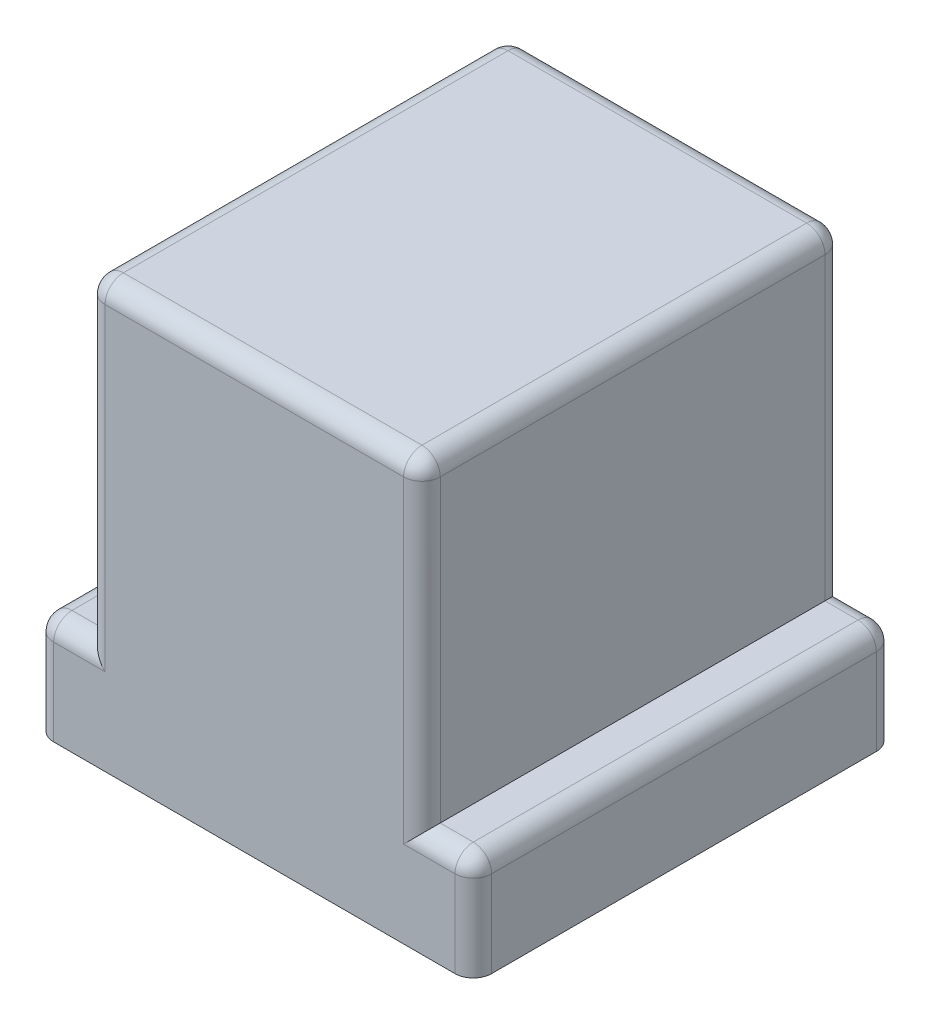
ISO-10303-21;
HEADER;
FILE_DESCRIPTION(('STEP AP214'),'2;1');
FILE_NAME('part.step','',(''),(''),'','','');
FILE_SCHEMA(('AUTOMOTIVE_DESIGN { 1 0 10303 214 1 1 1 1 }'));
ENDSEC;
DATA;
#1=APPLICATION_CONTEXT('core data for automotive mechanical design processes');
#2=APPLICATION_PROTOCOL_DEFINITION('international standard','automotive_design',2000,#1);
#3=PRODUCT_CONTEXT('',#1,'mechanical');
#4=PRODUCT('Part','Part','',(#3));
#5=PRODUCT_RELATED_PRODUCT_CATEGORY('part','',(#4));
#6=PRODUCT_DEFINITION_FORMATION('','',#4);
#7=PRODUCT_DEFINITION_CONTEXT('part definition',#1,'design');
#8=PRODUCT_DEFINITION('design','',#6,#7);
#9=PRODUCT_DEFINITION_SHAPE('','',#8);
#10=(LENGTH_UNIT() NAMED_UNIT(*) SI_UNIT(.MILLI.,.METRE.));
#11=(NAMED_UNIT(*) PLANE_ANGLE_UNIT() SI_UNIT($,.RADIAN.));
#12=(NAMED_UNIT(*) SI_UNIT($,.STERADIAN.) SOLID_ANGLE_UNIT());
#13=UNCERTAINTY_MEASURE_WITH_UNIT(LENGTH_MEASURE(1.E-05),#10,'distance_accuracy_value','');
#14=(GEOMETRIC_REPRESENTATION_CONTEXT(3) GLOBAL_UNCERTAINTY_ASSIGNED_CONTEXT((#13)) GLOBAL_UNIT_ASSIGNED_CONTEXT((#10,
#11,#12)) REPRESENTATION_CONTEXT('',''));
#15=CARTESIAN_POINT('',(0.,0.,0.));
#16=DIRECTION('',(0.,0.,1.));
#17=DIRECTION('',(1.,0.,0.));
#18=AXIS2_PLACEMENT_3D('',#15,#16,#17);
#19=CARTESIAN_POINT('',(-26.79,7.26,-29.2));
#20=DIRECTION('',(0.,-1.,0.));
#21=DIRECTION('',(0.,0.,-1.));
#22=AXIS2_PLACEMENT_3D('',#19,#20,#21);
#23=PLANE('',#22);
#24=DIRECTION('',(0.,0.,-1.));
#25=VECTOR('',#24,1.);
#26=CARTESIAN_POINT('',(-29.08,7.26,0.));
#27=LINE('',#26,#25);
#28=CARTESIAN_POINT('',(-29.08,7.26,-27.93));
#29=VERTEX_POINT('',#28);
#30=CARTESIAN_POINT('',(-29.08,7.26,-1.27));
#31=VERTEX_POINT('',#30);
#32=EDGE_CURVE('E408',#29,#31,#27,.F.);
#33=ORIENTED_EDGE('',*,*,#32,.T.);
#34=DIRECTION('',(1.,0.,0.));
#35=VECTOR('',#34,1.);
#36=CARTESIAN_POINT('',(-26.79,7.26,-1.27));
#37=LINE('',#36,#35);
#38=CARTESIAN_POINT('',(-26.79,7.26,-1.27));
#39=VERTEX_POINT('',#38);
#40=EDGE_CURVE('E412',#31,#39,#37,.T.);
#41=ORIENTED_EDGE('',*,*,#40,.T.);
#42=DIRECTION('',(0.,0.,1.));
#43=VECTOR('',#42,1.);
#44=CARTESIAN_POINT('',(-26.79,7.26,-29.2));
#45=LINE('',#44,#43);
#46=CARTESIAN_POINT('',(-26.79,7.26,-27.93));
#47=VERTEX_POINT('',#46);
#48=EDGE_CURVE('E377',#39,#47,#45,.F.);
#49=ORIENTED_EDGE('',*,*,#48,.T.);
#50=DIRECTION('',(1.,0.,0.));
#51=VECTOR('',#50,1.);
#52=CARTESIAN_POINT('',(-30.35,7.26,-27.93));
#53=LINE('',#52,#51);
#54=EDGE_CURVE('E410',#47,#29,#53,.F.);
#55=ORIENTED_EDGE('',*,*,#54,.T.);
#56=EDGE_LOOP('',(#33,#41,#49,#55));
#57=FACE_BOUND('',#56,.T.);
#58=ADVANCED_FACE('F36',(#57),#23,.F.);
#59=CARTESIAN_POINT('',(-26.79,29.3,-29.2));
#60=DIRECTION('',(1.,0.,0.));
#61=DIRECTION('',(0.,1.,0.));
#62=AXIS2_PLACEMENT_3D('',#59,#60,#61);
#63=PLANE('',#62);
#64=DIRECTION('',(0.,0.,1.));
#65=VECTOR('',#64,1.);
#66=CARTESIAN_POINT('',(-26.79,28.03,-29.2));
#67=LINE('',#66,#65);
#68=CARTESIAN_POINT('',(-26.79,28.03,-1.27));
#69=VERTEX_POINT('',#68);
#70=CARTESIAN_POINT('',(-26.79,28.03,-27.93));
#71=VERTEX_POINT('',#70);
#72=EDGE_CURVE('E442',#69,#71,#67,.F.);
#73=ORIENTED_EDGE('',*,*,#72,.T.);
#74=DIRECTION('',(0.,1.,0.));
#75=VECTOR('',#74,1.);
#76=CARTESIAN_POINT('',(-26.79,7.26,-27.93));
#77=LINE('',#76,#75);
#78=EDGE_CURVE('E446',#71,#47,#77,.F.);
#79=ORIENTED_EDGE('',*,*,#78,.T.);
#80=ORIENTED_EDGE('',*,*,#48,.F.);
#81=DIRECTION('',(0.,1.,0.));
#82=VECTOR('',#81,1.);
#83=CARTESIAN_POINT('',(-26.79,29.3,-1.27));
#84=LINE('',#83,#82);
#85=EDGE_CURVE('E444',#39,#69,#84,.T.);
#86=ORIENTED_EDGE('',*,*,#85,.T.);
#87=EDGE_LOOP('',(#73,#79,#80,#86));
#88=FACE_BOUND('',#87,.T.);
#89=ADVANCED_FACE('F1195',(#88),#63,.F.);
#90=CARTESIAN_POINT('',(-30.35,29.3,-29.2));
#91=DIRECTION('',(0.,1.,0.));
#92=DIRECTION('',(0.,0.,1.));
#93=AXIS2_PLACEMENT_3D('',#90,#91,#92);
#94=PLANE('',#93);
#95=DIRECTION('',(1.,0.,0.));
#96=VECTOR('',#95,1.);
#97=CARTESIAN_POINT('',(-30.35,29.3,-27.93));
#98=LINE('',#97,#96);
#99=CARTESIAN_POINT('',(-4.83,29.3,-27.93));
#100=VERTEX_POINT('',#99);
#101=CARTESIAN_POINT('',(-25.52,29.3,-27.93));
#102=VERTEX_POINT('',#101);
#103=EDGE_CURVE('E452',#100,#102,#98,.F.);
#104=ORIENTED_EDGE('',*,*,#103,.T.);
#105=DIRECTION('',(0.,0.,1.));
#106=VECTOR('',#105,1.);
#107=CARTESIAN_POINT('',(-25.52,29.3,0.));
#108=LINE('',#107,#106);
#109=CARTESIAN_POINT('',(-25.52,29.3,-1.27));
#110=VERTEX_POINT('',#109);
#111=EDGE_CURVE('E455',#102,#110,#108,.T.);
#112=ORIENTED_EDGE('',*,*,#111,.T.);
#113=DIRECTION('',(1.,0.,0.));
#114=VECTOR('',#113,1.);
#115=CARTESIAN_POINT('',(-3.56,29.3,-1.27));
#116=LINE('',#115,#114);
#117=CARTESIAN_POINT('',(-4.83,29.3,-1.27));
#118=VERTEX_POINT('',#117);
#119=EDGE_CURVE('E450',#110,#118,#116,.T.);
#120=ORIENTED_EDGE('',*,*,#119,.T.);
#121=DIRECTION('',(0.,0.,-1.));
#122=VECTOR('',#121,1.);
#123=CARTESIAN_POINT('',(-4.83,29.3,-29.2));
#124=LINE('',#123,#122);
#125=EDGE_CURVE('E448',#118,#100,#124,.T.);
#126=ORIENTED_EDGE('',*,*,#125,.T.);
#127=EDGE_LOOP('',(#104,#112,#120,#126));
#128=FACE_BOUND('',#127,.T.);
#129=ADVANCED_FACE('F591',(#128),#94,.T.);
#130=CARTESIAN_POINT('',(-3.56,29.3,-29.2));
#131=DIRECTION('',(-1.,0.,0.));
#132=DIRECTION('',(0.,-1.,0.));
#133=AXIS2_PLACEMENT_3D('',#130,#131,#132);
#134=PLANE('',#133);
#135=DIRECTION('',(0.,0.,-1.));
#136=VECTOR('',#135,1.);
#137=CARTESIAN_POINT('',(-3.56,7.26,-29.2));
#138=LINE('',#137,#136);
#139=CARTESIAN_POINT('',(-3.56,7.26,-1.27));
#140=VERTEX_POINT('',#139);
#141=CARTESIAN_POINT('',(-3.56,7.26,-27.93));
#142=VERTEX_POINT('',#141);
#143=EDGE_CURVE('E374',#140,#142,#138,.T.);
#144=ORIENTED_EDGE('',*,*,#143,.T.);
#145=DIRECTION('',(0.,-1.,0.));
#146=VECTOR('',#145,1.);
#147=CARTESIAN_POINT('',(-3.56,29.3,-27.93));
#148=LINE('',#147,#146);
#149=CARTESIAN_POINT('',(-3.56,28.03,-27.93));
#150=VERTEX_POINT('',#149);
#151=EDGE_CURVE('E11',#142,#150,#148,.F.);
#152=ORIENTED_EDGE('',*,*,#151,.T.);
#153=DIRECTION('',(0.,0.,-1.));
#154=VECTOR('',#153,1.);
#155=CARTESIAN_POINT('',(-3.56,28.03,0.));
#156=LINE('',#155,#154);
#157=CARTESIAN_POINT('',(-3.56,28.03,-1.27));
#158=VERTEX_POINT('',#157);
#159=EDGE_CURVE('E60',#150,#158,#156,.F.);
#160=ORIENTED_EDGE('',*,*,#159,.T.);
#161=DIRECTION('',(0.,-1.,0.));
#162=VECTOR('',#161,1.);
#163=CARTESIAN_POINT('',(-3.56,29.3,-1.27));
#164=LINE('',#163,#162);
#165=EDGE_CURVE('E45',#158,#140,#164,.T.);
#166=ORIENTED_EDGE('',*,*,#165,.T.);
#167=EDGE_LOOP('',(#144,#152,#160,#166));
#168=FACE_BOUND('',#167,.T.);
#169=ADVANCED_FACE('F619',(#168),#134,.F.);
#170=CARTESIAN_POINT('',(-3.56,7.26,-29.2));
#171=DIRECTION('',(0.,-1.,0.));
#172=DIRECTION('',(0.,0.,-1.));
#173=AXIS2_PLACEMENT_3D('',#170,#171,#172);
#174=PLANE('',#173);
#175=ORIENTED_EDGE('',*,*,#143,.F.);
#176=DIRECTION('',(1.,0.,0.));
#177=VECTOR('',#176,1.);
#178=CARTESIAN_POINT('',(-3.56,7.26,-1.27));
#179=LINE('',#178,#177);
#180=CARTESIAN_POINT('',(-1.27,7.26,-1.27));
#181=VERTEX_POINT('',#180);
#182=EDGE_CURVE('E419',#140,#181,#179,.T.);
#183=ORIENTED_EDGE('',*,*,#182,.T.);
#184=DIRECTION('',(0.,0.,1.));
#185=VECTOR('',#184,1.);
#186=CARTESIAN_POINT('',(-1.27,7.26,-29.2));
#187=LINE('',#186,#185);
#188=CARTESIAN_POINT('',(-1.27,7.26,-27.93));
#189=VERTEX_POINT('',#188);
#190=EDGE_CURVE('E415',#181,#189,#187,.F.);
#191=ORIENTED_EDGE('',*,*,#190,.T.);
#192=DIRECTION('',(1.,0.,0.));
#193=VECTOR('',#192,1.);
#194=CARTESIAN_POINT('',(-3.56,7.26,-27.93));
#195=LINE('',#194,#193);
#196=EDGE_CURVE('E417',#189,#142,#195,.F.);
#197=ORIENTED_EDGE('',*,*,#196,.T.);
#198=EDGE_LOOP('',(#175,#183,#191,#197));
#199=FACE_BOUND('',#198,.T.);
#200=ADVANCED_FACE('F616',(#199),#174,.F.);
#201=CARTESIAN_POINT('',(0.,0.,0.));
#202=DIRECTION('',(0.,0.,-1.));
#203=DIRECTION('',(-1.,0.,0.));
#204=AXIS2_PLACEMENT_3D('',#201,#202,#203);
#205=PLANE('',#204);
#206=DIRECTION('',(1.,0.,0.));
#207=VECTOR('',#206,1.);
#208=CARTESIAN_POINT('',(0.,0.,0.));
#209=LINE('',#208,#207);
#210=CARTESIAN_POINT('',(-1.27,0.,0.));
#211=VERTEX_POINT('',#210);
#212=CARTESIAN_POINT('',(-29.08,0.,0.));
#213=VERTEX_POINT('',#212);
#214=EDGE_CURVE('E371',#211,#213,#209,.F.);
#215=ORIENTED_EDGE('',*,*,#214,.F.);
#216=DIRECTION('',(0.,-1.,0.));
#217=VECTOR('',#216,1.);
#218=CARTESIAN_POINT('',(-1.27,7.26,0.));
#219=LINE('',#218,#217);
#220=CARTESIAN_POINT('',(-1.27,5.99,0.));
#221=VERTEX_POINT('',#220);
#222=EDGE_CURVE('E398',#211,#221,#219,.F.);
#223=ORIENTED_EDGE('',*,*,#222,.T.);
#224=DIRECTION('',(1.,0.,0.));
#225=VECTOR('',#224,1.);
#226=CARTESIAN_POINT('',(0.,5.99,0.));
#227=LINE('',#226,#225);
#228=CARTESIAN_POINT('',(-4.83,5.99,0.));
#229=VERTEX_POINT('',#228);
#230=EDGE_CURVE('E392',#221,#229,#227,.F.);
#231=ORIENTED_EDGE('',*,*,#230,.T.);
#232=DIRECTION('',(0.,-1.,0.));
#233=VECTOR('',#232,1.);
#234=CARTESIAN_POINT('',(-4.83000000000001,0.,0.));
#235=LINE('',#234,#233);
#236=CARTESIAN_POINT('',(-4.83,28.03,0.));
#237=VERTEX_POINT('',#236);
#238=EDGE_CURVE('E386',#229,#237,#235,.F.);
#239=ORIENTED_EDGE('',*,*,#238,.T.);
#240=DIRECTION('',(1.,0.,0.));
#241=VECTOR('',#240,1.);
#242=CARTESIAN_POINT('',(-26.79,28.03,0.));
#243=LINE('',#242,#241);
#244=CARTESIAN_POINT('',(-25.52,28.03,0.));
#245=VERTEX_POINT('',#244);
#246=EDGE_CURVE('E388',#237,#245,#243,.F.);
#247=ORIENTED_EDGE('',*,*,#246,.T.);
#248=DIRECTION('',(0.,1.,0.));
#249=VECTOR('',#248,1.);
#250=CARTESIAN_POINT('',(-25.52,0.,0.));
#251=LINE('',#250,#249);
#252=CARTESIAN_POINT('',(-25.52,5.99,0.));
#253=VERTEX_POINT('',#252);
#254=EDGE_CURVE('E390',#245,#253,#251,.F.);
#255=ORIENTED_EDGE('',*,*,#254,.T.);
#256=DIRECTION('',(1.,0.,0.));
#257=VECTOR('',#256,1.);
#258=CARTESIAN_POINT('',(0.,5.99,0.));
#259=LINE('',#258,#257);
#260=CARTESIAN_POINT('',(-29.08,5.99,0.));
#261=VERTEX_POINT('',#260);
#262=EDGE_CURVE('E394',#253,#261,#259,.F.);
#263=ORIENTED_EDGE('',*,*,#262,.T.);
#264=DIRECTION('',(0.,1.,0.));
#265=VECTOR('',#264,1.);
#266=CARTESIAN_POINT('',(-29.08,0.,0.));
#267=LINE('',#266,#265);
#268=EDGE_CURVE('E396',#261,#213,#267,.F.);
#269=ORIENTED_EDGE('',*,*,#268,.T.);
#270=EDGE_LOOP('',(#215,#223,#231,#239,#247,#255,#263,#269));
#271=FACE_BOUND('',#270,.T.);
#272=ADVANCED_FACE('F644',(#271),#205,.F.);
#273=CARTESIAN_POINT('',(-30.35,0.,-29.2));
#274=DIRECTION('',(-1.,0.,0.));
#275=DIRECTION('',(0.,0.,1.));
#276=AXIS2_PLACEMENT_3D('',#273,#274,#275);
#277=PLANE('',#276);
#278=DIRECTION('',(0.,0.,1.));
#279=VECTOR('',#278,1.);
#280=CARTESIAN_POINT('',(-30.35,0.,-29.2));
#281=LINE('',#280,#279);
#282=CARTESIAN_POINT('',(-30.35,0.,-1.27));
#283=VERTEX_POINT('',#282);
#284=CARTESIAN_POINT('',(-30.35,0.,-27.93));
#285=VERTEX_POINT('',#284);
#286=EDGE_CURVE('E368',#283,#285,#281,.F.);
#287=ORIENTED_EDGE('',*,*,#286,.F.);
#288=DIRECTION('',(0.,1.,0.));
#289=VECTOR('',#288,1.);
#290=CARTESIAN_POINT('',(-30.35,7.26,-1.27));
#291=LINE('',#290,#289);
#292=CARTESIAN_POINT('',(-30.35,5.99,-1.27));
#293=VERTEX_POINT('',#292);
#294=EDGE_CURVE('E383',#283,#293,#291,.T.);
#295=ORIENTED_EDGE('',*,*,#294,.T.);
#296=DIRECTION('',(0.,0.,-1.));
#297=VECTOR('',#296,1.);
#298=CARTESIAN_POINT('',(-30.35,5.99,-29.2));
#299=LINE('',#298,#297);
#300=CARTESIAN_POINT('',(-30.35,5.99,-27.93));
#301=VERTEX_POINT('',#300);
#302=EDGE_CURVE('E364',#293,#301,#299,.T.);
#303=ORIENTED_EDGE('',*,*,#302,.T.);
#304=DIRECTION('',(0.,1.,0.));
#305=VECTOR('',#304,1.);
#306=CARTESIAN_POINT('',(-30.35,0.,-27.93));
#307=LINE('',#306,#305);
#308=EDGE_CURVE('E381',#301,#285,#307,.F.);
#309=ORIENTED_EDGE('',*,*,#308,.T.);
#310=EDGE_LOOP('',(#287,#295,#303,#309));
#311=FACE_BOUND('',#310,.T.);
#312=ADVANCED_FACE('F660',(#311),#277,.T.);
#313=CARTESIAN_POINT('',(0.,0.,-29.2));
#314=DIRECTION('',(0.,0.,-1.));
#315=DIRECTION('',(-1.,0.,0.));
#316=AXIS2_PLACEMENT_3D('',#313,#314,#315);
#317=PLANE('',#316);
#318=DIRECTION('',(1.,0.,0.));
#319=VECTOR('',#318,1.);
#320=CARTESIAN_POINT('',(0.,5.99,-29.2));
#321=LINE('',#320,#319);
#322=CARTESIAN_POINT('',(-4.83,5.99,-29.2));
#323=VERTEX_POINT('',#322);
#324=CARTESIAN_POINT('',(-1.27,5.99,-29.2));
#325=VERTEX_POINT('',#324);
#326=EDGE_CURVE('E428',#323,#325,#321,.T.);
#327=ORIENTED_EDGE('',*,*,#326,.T.);
#328=DIRECTION('',(0.,1.,0.));
#329=VECTOR('',#328,1.);
#330=CARTESIAN_POINT('',(-1.27,0.,-29.2));
#331=LINE('',#330,#329);
#332=CARTESIAN_POINT('',(-1.27,0.,-29.2));
#333=VERTEX_POINT('',#332);
#334=EDGE_CURVE('E434',#325,#333,#331,.F.);
#335=ORIENTED_EDGE('',*,*,#334,.T.);
#336=DIRECTION('',(1.,0.,0.));
#337=VECTOR('',#336,1.);
#338=CARTESIAN_POINT('',(0.,0.,-29.2));
#339=LINE('',#338,#337);
#340=CARTESIAN_POINT('',(-29.08,0.,-29.2));
#341=VERTEX_POINT('',#340);
#342=EDGE_CURVE('E365',#341,#333,#339,.T.);
#343=ORIENTED_EDGE('',*,*,#342,.F.);
#344=DIRECTION('',(0.,1.,0.));
#345=VECTOR('',#344,1.);
#346=CARTESIAN_POINT('',(-29.08,0.,-29.2));
#347=LINE('',#346,#345);
#348=CARTESIAN_POINT('',(-29.08,5.99,-29.2));
#349=VERTEX_POINT('',#348);
#350=EDGE_CURVE('E432',#341,#349,#347,.T.);
#351=ORIENTED_EDGE('',*,*,#350,.T.);
#352=DIRECTION('',(1.,0.,0.));
#353=VECTOR('',#352,1.);
#354=CARTESIAN_POINT('',(-26.79,5.99,-29.2));
#355=LINE('',#354,#353);
#356=CARTESIAN_POINT('',(-25.52,5.99,-29.2));
#357=VERTEX_POINT('',#356);
#358=EDGE_CURVE('E430',#349,#357,#355,.T.);
#359=ORIENTED_EDGE('',*,*,#358,.T.);
#360=DIRECTION('',(0.,1.,0.));
#361=VECTOR('',#360,1.);
#362=CARTESIAN_POINT('',(-25.52,29.3,-29.2));
#363=LINE('',#362,#361);
#364=CARTESIAN_POINT('',(-25.52,28.03,-29.2));
#365=VERTEX_POINT('',#364);
#366=EDGE_CURVE('E426',#357,#365,#363,.T.);
#367=ORIENTED_EDGE('',*,*,#366,.T.);
#368=DIRECTION('',(1.,0.,0.));
#369=VECTOR('',#368,1.);
#370=CARTESIAN_POINT('',(0.,28.03,-29.2));
#371=LINE('',#370,#369);
#372=CARTESIAN_POINT('',(-4.83,28.03,-29.2));
#373=VERTEX_POINT('',#372);
#374=EDGE_CURVE('E424',#365,#373,#371,.T.);
#375=ORIENTED_EDGE('',*,*,#374,.T.);
#376=DIRECTION('',(0.,-1.,0.));
#377=VECTOR('',#376,1.);
#378=CARTESIAN_POINT('',(-4.83,7.26,-29.2));
#379=LINE('',#378,#377);
#380=EDGE_CURVE('E422',#373,#323,#379,.T.);
#381=ORIENTED_EDGE('',*,*,#380,.T.);
#382=EDGE_LOOP('',(#327,#335,#343,#351,#359,#367,#375,#381));
#383=FACE_BOUND('',#382,.T.);
#384=ADVANCED_FACE('F552',(#383),#317,.T.);
#385=CARTESIAN_POINT('',(0.,29.3,-29.2));
#386=DIRECTION('',(1.,0.,0.));
#387=DIRECTION('',(0.,1.,0.));
#388=AXIS2_PLACEMENT_3D('',#385,#386,#387);
#389=PLANE('',#388);
#390=DIRECTION('',(0.,0.,1.));
#391=VECTOR('',#390,1.);
#392=CARTESIAN_POINT('',(0.,5.99,0.));
#393=LINE('',#392,#391);
#394=CARTESIAN_POINT('',(0.,5.99,-27.93));
#395=VERTEX_POINT('',#394);
#396=CARTESIAN_POINT('',(0.,5.99,-1.27));
#397=VERTEX_POINT('',#396);
#398=EDGE_CURVE('E436',#395,#397,#393,.T.);
#399=ORIENTED_EDGE('',*,*,#398,.T.);
#400=DIRECTION('',(0.,-1.,0.));
#401=VECTOR('',#400,1.);
#402=CARTESIAN_POINT('',(0.,0.,-1.27));
#403=LINE('',#402,#401);
#404=CARTESIAN_POINT('',(0.,0.,-1.27));
#405=VERTEX_POINT('',#404);
#406=EDGE_CURVE('E440',#397,#405,#403,.T.);
#407=ORIENTED_EDGE('',*,*,#406,.T.);
#408=DIRECTION('',(0.,0.,1.));
#409=VECTOR('',#408,1.);
#410=CARTESIAN_POINT('',(0.,0.,-29.2));
#411=LINE('',#410,#409);
#412=CARTESIAN_POINT('',(0.,0.,-27.93));
#413=VERTEX_POINT('',#412);
#414=EDGE_CURVE('E361',#413,#405,#411,.T.);
#415=ORIENTED_EDGE('',*,*,#414,.F.);
#416=DIRECTION('',(0.,1.,0.));
#417=VECTOR('',#416,1.);
#418=CARTESIAN_POINT('',(0.,29.3,-27.93));
#419=LINE('',#418,#417);
#420=EDGE_CURVE('E438',#413,#395,#419,.T.);
#421=ORIENTED_EDGE('',*,*,#420,.T.);
#422=EDGE_LOOP('',(#399,#407,#415,#421));
#423=FACE_BOUND('',#422,.T.);
#424=ADVANCED_FACE('F636',(#423),#389,.T.);
#425=CARTESIAN_POINT('',(0.,0.,-29.2));
#426=DIRECTION('',(0.,-1.,0.));
#427=DIRECTION('',(1.,0.,0.));
#428=AXIS2_PLACEMENT_3D('',#425,#426,#427);
#429=PLANE('',#428);
#430=DIRECTION('',(-1.,0.,0.));
#431=VECTOR('',#430,1.);
#432=CARTESIAN_POINT('',(0.,0.,-0.254));
#433=LINE('',#432,#431);
#434=CARTESIAN_POINT('',(-1.27,0.,-0.254));
#435=VERTEX_POINT('',#434);
#436=CARTESIAN_POINT('',(-29.08,0.,-0.254));
#437=VERTEX_POINT('',#436);
#438=EDGE_CURVE('E352',#435,#437,#433,.T.);
#439=ORIENTED_EDGE('',*,*,#438,.F.);
#440=CARTESIAN_POINT('',(-1.27,0.,-1.27));
#441=DIRECTION('',(0.,-1.,0.));
#442=DIRECTION('',(1.,0.,0.));
#443=AXIS2_PLACEMENT_3D('',#440,#441,#442);
#444=CIRCLE('',#443,1.016);
#445=CARTESIAN_POINT('',(-0.254,0.,-1.27));
#446=VERTEX_POINT('',#445);
#447=EDGE_CURVE('E347',#446,#435,#444,.T.);
#448=ORIENTED_EDGE('',*,*,#447,.F.);
#449=DIRECTION('',(0.,0.,1.));
#450=VECTOR('',#449,1.);
#451=CARTESIAN_POINT('',(-0.254,0.,-29.2));
#452=LINE('',#451,#450);
#453=CARTESIAN_POINT('',(-0.254,0.,-27.93));
#454=VERTEX_POINT('',#453);
#455=EDGE_CURVE('E53',#454,#446,#452,.T.);
#456=ORIENTED_EDGE('',*,*,#455,.F.);
#457=CARTESIAN_POINT('',(-1.27,0.,-27.93));
#458=DIRECTION('',(0.,-1.,0.));
#459=DIRECTION('',(1.,0.,0.));
#460=AXIS2_PLACEMENT_3D('',#457,#458,#459);
#461=CIRCLE('',#460,1.016);
#462=CARTESIAN_POINT('',(-1.27,0.,-28.946));
#463=VERTEX_POINT('',#462);
#464=EDGE_CURVE('E345',#463,#454,#461,.T.);
#465=ORIENTED_EDGE('',*,*,#464,.F.);
#466=DIRECTION('',(1.,0.,0.));
#467=VECTOR('',#466,1.);
#468=CARTESIAN_POINT('',(0.,0.,-28.946));
#469=LINE('',#468,#467);
#470=CARTESIAN_POINT('',(-29.08,0.,-28.946));
#471=VERTEX_POINT('',#470);
#472=EDGE_CURVE('E341',#471,#463,#469,.T.);
#473=ORIENTED_EDGE('',*,*,#472,.F.);
#474=CARTESIAN_POINT('',(-29.08,0.,-27.93));
#475=DIRECTION('',(0.,-1.,0.));
#476=DIRECTION('',(1.,0.,0.));
#477=AXIS2_PLACEMENT_3D('',#474,#475,#476);
#478=CIRCLE('',#477,1.016);
#479=CARTESIAN_POINT('',(-30.096,0.,-27.93));
#480=VERTEX_POINT('',#479);
#481=EDGE_CURVE('E348',#480,#471,#478,.T.);
#482=ORIENTED_EDGE('',*,*,#481,.F.);
#483=DIRECTION('',(0.,0.,-1.));
#484=VECTOR('',#483,1.);
#485=CARTESIAN_POINT('',(-30.096,0.,-29.2));
#486=LINE('',#485,#484);
#487=CARTESIAN_POINT('',(-30.096,0.,-1.27));
#488=VERTEX_POINT('',#487);
#489=EDGE_CURVE('E344',#488,#480,#486,.T.);
#490=ORIENTED_EDGE('',*,*,#489,.F.);
#491=CARTESIAN_POINT('',(-29.08,0.,-1.27));
#492=DIRECTION('',(0.,-1.,0.));
#493=DIRECTION('',(1.,0.,0.));
#494=AXIS2_PLACEMENT_3D('',#491,#492,#493);
#495=CIRCLE('',#494,1.016);
#496=EDGE_CURVE('E308',#437,#488,#495,.T.);
#497=ORIENTED_EDGE('',*,*,#496,.F.);
#498=EDGE_LOOP('',(#439,#448,#456,#465,#473,#482,#490,#497));
#499=FACE_BOUND('',#498,.T.);
#500=ORIENTED_EDGE('',*,*,#214,.T.);
#501=CARTESIAN_POINT('',(-29.08,0.,-1.27));
#502=DIRECTION('',(0.,-1.,0.));
#503=DIRECTION('',(1.,0.,0.));
#504=AXIS2_PLACEMENT_3D('',#501,#502,#503);
#505=CIRCLE('',#504,1.27);
#506=EDGE_CURVE('E406',#213,#283,#505,.T.);
#507=ORIENTED_EDGE('',*,*,#506,.T.);
#508=ORIENTED_EDGE('',*,*,#286,.T.);
#509=CARTESIAN_POINT('',(-29.08,0.,-27.93));
#510=DIRECTION('',(0.,-1.,0.));
#511=DIRECTION('',(1.,0.,0.));
#512=AXIS2_PLACEMENT_3D('',#509,#510,#511);
#513=CIRCLE('',#512,1.27);
#514=EDGE_CURVE('E400',#285,#341,#513,.T.);
#515=ORIENTED_EDGE('',*,*,#514,.T.);
#516=ORIENTED_EDGE('',*,*,#342,.T.);
#517=CARTESIAN_POINT('',(-1.27,0.,-27.93));
#518=DIRECTION('',(0.,-1.,0.));
#519=DIRECTION('',(1.,0.,0.));
#520=AXIS2_PLACEMENT_3D('',#517,#518,#519);
#521=CIRCLE('',#520,1.27);
#522=EDGE_CURVE('E402',#333,#413,#521,.T.);
#523=ORIENTED_EDGE('',*,*,#522,.T.);
#524=ORIENTED_EDGE('',*,*,#414,.T.);
#525=CARTESIAN_POINT('',(-1.27,0.,-1.27));
#526=DIRECTION('',(0.,-1.,0.));
#527=DIRECTION('',(1.,0.,0.));
#528=AXIS2_PLACEMENT_3D('',#525,#526,#527);
#529=CIRCLE('',#528,1.27);
#530=EDGE_CURVE('E404',#405,#211,#529,.T.);
#531=ORIENTED_EDGE('',*,*,#530,.T.);
#532=EDGE_LOOP('',(#500,#507,#508,#515,#516,#523,#524,#531));
#533=FACE_BOUND('',#532,.T.);
#534=ADVANCED_FACE('F555',(#499,#533),#429,.T.);
#535=CARTESIAN_POINT('',(-1.27,29.3,-27.93));
#536=DIRECTION('',(0.,1.,0.));
#537=DIRECTION('',(-1.,0.,0.));
#538=AXIS2_PLACEMENT_3D('',#535,#536,#537);
#539=CYLINDRICAL_SURFACE('',#538,1.27);
#540=CARTESIAN_POINT('',(-1.27,5.99,-27.93));
#541=DIRECTION('',(0.,1.,0.));
#542=DIRECTION('',(0.,0.,1.));
#543=AXIS2_PLACEMENT_3D('',#540,#541,#542);
#544=CIRCLE('',#543,1.27);
#545=EDGE_CURVE('E40',#395,#325,#544,.T.);
#546=ORIENTED_EDGE('',*,*,#545,.F.);
#547=ORIENTED_EDGE('',*,*,#420,.F.);
#548=ORIENTED_EDGE('',*,*,#522,.F.);
#549=ORIENTED_EDGE('',*,*,#334,.F.);
#550=EDGE_LOOP('',(#546,#547,#548,#549));
#551=FACE_BOUND('',#550,.T.);
#552=ADVANCED_FACE('F38',(#551),#539,.T.);
#553=CARTESIAN_POINT('',(-1.27,5.99,-27.93));
#554=DIRECTION('',(0.,0.,1.));
#555=DIRECTION('',(1.,0.,0.));
#556=AXIS2_PLACEMENT_3D('',#553,#554,#555);
#557=SPHERICAL_SURFACE('',#556,1.27);
#558=CARTESIAN_POINT('',(-1.27,5.99,-27.93));
#559=DIRECTION('',(0.,0.,-1.));
#560=DIRECTION('',(-1.,0.,0.));
#561=AXIS2_PLACEMENT_3D('',#558,#559,#560);
#562=CIRCLE('',#561,1.27);
#563=EDGE_CURVE('E532',#395,#189,#562,.F.);
#564=ORIENTED_EDGE('',*,*,#563,.F.);
#565=ORIENTED_EDGE('',*,*,#545,.T.);
#566=CARTESIAN_POINT('',(-1.27,5.99,-27.93));
#567=DIRECTION('',(1.,0.,0.));
#568=DIRECTION('',(0.,0.,-1.));
#569=AXIS2_PLACEMENT_3D('',#566,#567,#568);
#570=CIRCLE('',#569,1.27);
#571=EDGE_CURVE('E534',#189,#325,#570,.F.);
#572=ORIENTED_EDGE('',*,*,#571,.F.);
#573=EDGE_LOOP('',(#564,#565,#572));
#574=FACE_BOUND('',#573,.T.);
#575=ADVANCED_FACE('F544',(#574),#557,.T.);
#576=CARTESIAN_POINT('',(0.,5.99,-27.93));
#577=DIRECTION('',(-1.,0.,0.));
#578=DIRECTION('',(0.,0.,1.));
#579=AXIS2_PLACEMENT_3D('',#576,#577,#578);
#580=CYLINDRICAL_SURFACE('',#579,1.27);
#581=ORIENTED_EDGE('',*,*,#571,.T.);
#582=ORIENTED_EDGE('',*,*,#326,.F.);
#583=CARTESIAN_POINT('',(-4.83,5.99,-27.93));
#584=DIRECTION('',(-0.707106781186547,0.707106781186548,0.));
#585=DIRECTION('',(-0.707106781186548,-0.707106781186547,0.));
#586=AXIS2_PLACEMENT_3D('',#583,#584,#585);
#587=ELLIPSE('',#586,1.79605122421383,1.27);
#588=EDGE_CURVE('E529',#142,#323,#587,.T.);
#589=ORIENTED_EDGE('',*,*,#588,.F.);
#590=ORIENTED_EDGE('',*,*,#196,.F.);
#591=EDGE_LOOP('',(#581,#582,#589,#590));
#592=FACE_BOUND('',#591,.T.);
#593=ADVANCED_FACE('F613',(#592),#580,.T.);
#594=CARTESIAN_POINT('',(-1.27,5.99,-29.2));
#595=DIRECTION('',(0.,0.,-1.));
#596=DIRECTION('',(-1.,0.,0.));
#597=AXIS2_PLACEMENT_3D('',#594,#595,#596);
#598=CYLINDRICAL_SURFACE('',#597,1.27);
#599=ORIENTED_EDGE('',*,*,#563,.T.);
#600=ORIENTED_EDGE('',*,*,#190,.F.);
#601=CARTESIAN_POINT('',(-1.27,5.99,-1.27));
#602=DIRECTION('',(0.,0.,1.));
#603=DIRECTION('',(1.,0.,0.));
#604=AXIS2_PLACEMENT_3D('',#601,#602,#603);
#605=CIRCLE('',#604,1.27);
#606=EDGE_CURVE('E526',#397,#181,#605,.T.);
#607=ORIENTED_EDGE('',*,*,#606,.F.);
#608=ORIENTED_EDGE('',*,*,#398,.F.);
#609=EDGE_LOOP('',(#599,#600,#607,#608));
#610=FACE_BOUND('',#609,.T.);
#611=ADVANCED_FACE('F633',(#610),#598,.T.);
#612=CARTESIAN_POINT('',(-1.27,29.3,-1.27));
#613=DIRECTION('',(0.,1.,0.));
#614=DIRECTION('',(-1.,0.,0.));
#615=AXIS2_PLACEMENT_3D('',#612,#613,#614);
#616=CYLINDRICAL_SURFACE('',#615,1.27);
#617=ORIENTED_EDGE('',*,*,#530,.F.);
#618=ORIENTED_EDGE('',*,*,#406,.F.);
#619=CARTESIAN_POINT('',(-1.27,5.99,-1.27));
#620=DIRECTION('',(0.,1.,0.));
#621=DIRECTION('',(0.,0.,1.));
#622=AXIS2_PLACEMENT_3D('',#619,#620,#621);
#623=CIRCLE('',#622,1.27);
#624=EDGE_CURVE('E523',#221,#397,#623,.T.);
#625=ORIENTED_EDGE('',*,*,#624,.F.);
#626=ORIENTED_EDGE('',*,*,#222,.F.);
#627=EDGE_LOOP('',(#617,#618,#625,#626));
#628=FACE_BOUND('',#627,.T.);
#629=ADVANCED_FACE('F639',(#628),#616,.T.);
#630=CARTESIAN_POINT('',(-4.83000000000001,0.,-27.93));
#631=DIRECTION('',(0.,1.,0.));
#632=DIRECTION('',(-1.,0.,0.));
#633=AXIS2_PLACEMENT_3D('',#630,#631,#632);
#634=CYLINDRICAL_SURFACE('',#633,1.27);
#635=ORIENTED_EDGE('',*,*,#588,.T.);
#636=ORIENTED_EDGE('',*,*,#380,.F.);
#637=CARTESIAN_POINT('',(-4.83,28.03,-27.93));
#638=DIRECTION('',(0.,1.,0.));
#639=DIRECTION('',(0.,0.,1.));
#640=AXIS2_PLACEMENT_3D('',#637,#638,#639);
#641=CIRCLE('',#640,1.27);
#642=EDGE_CURVE('E520',#150,#373,#641,.T.);
#643=ORIENTED_EDGE('',*,*,#642,.F.);
#644=ORIENTED_EDGE('',*,*,#151,.F.);
#645=EDGE_LOOP('',(#635,#636,#643,#644));
#646=FACE_BOUND('',#645,.T.);
#647=ADVANCED_FACE('F611',(#646),#634,.T.);
#648=CARTESIAN_POINT('',(-1.27,5.99,-1.27));
#649=DIRECTION('',(0.,0.,1.));
#650=DIRECTION('',(1.,0.,0.));
#651=AXIS2_PLACEMENT_3D('',#648,#649,#650);
#652=SPHERICAL_SURFACE('',#651,1.27);
#653=ORIENTED_EDGE('',*,*,#624,.T.);
#654=ORIENTED_EDGE('',*,*,#606,.T.);
#655=CARTESIAN_POINT('',(-1.27,5.99,-1.27));
#656=DIRECTION('',(1.,0.,0.));
#657=DIRECTION('',(0.,0.,-1.));
#658=AXIS2_PLACEMENT_3D('',#655,#656,#657);
#659=CIRCLE('',#658,1.27);
#660=EDGE_CURVE('E518',#221,#181,#659,.F.);
#661=ORIENTED_EDGE('',*,*,#660,.F.);
#662=EDGE_LOOP('',(#653,#654,#661));
#663=FACE_BOUND('',#662,.T.);
#664=ADVANCED_FACE('F630',(#663),#652,.T.);
#665=CARTESIAN_POINT('',(-4.83,28.03,-27.93));
#666=DIRECTION('',(0.,0.,1.));
#667=DIRECTION('',(1.,0.,0.));
#668=AXIS2_PLACEMENT_3D('',#665,#666,#667);
#669=SPHERICAL_SURFACE('',#668,1.27);
#670=CARTESIAN_POINT('',(-4.83,28.03,-27.93));
#671=DIRECTION('',(0.,0.,-1.));
#672=DIRECTION('',(-1.,0.,0.));
#673=AXIS2_PLACEMENT_3D('',#670,#671,#672);
#674=CIRCLE('',#673,1.27);
#675=EDGE_CURVE('E512',#150,#100,#674,.F.);
#676=ORIENTED_EDGE('',*,*,#675,.F.);
#677=ORIENTED_EDGE('',*,*,#642,.T.);
#678=CARTESIAN_POINT('',(-4.83,28.03,-27.93));
#679=DIRECTION('',(1.,0.,0.));
#680=DIRECTION('',(0.,0.,-1.));
#681=AXIS2_PLACEMENT_3D('',#678,#679,#680);
#682=CIRCLE('',#681,1.27);
#683=EDGE_CURVE('E515',#100,#373,#682,.F.);
#684=ORIENTED_EDGE('',*,*,#683,.F.);
#685=EDGE_LOOP('',(#676,#677,#684));
#686=FACE_BOUND('',#685,.T.);
#687=ADVANCED_FACE('F607',(#686),#669,.T.);
#688=CARTESIAN_POINT('',(-3.56,5.99,-1.27));
#689=DIRECTION('',(1.,0.,0.));
#690=DIRECTION('',(0.,0.,-1.));
#691=AXIS2_PLACEMENT_3D('',#688,#689,#690);
#692=CYLINDRICAL_SURFACE('',#691,1.27);
#693=ORIENTED_EDGE('',*,*,#660,.T.);
#694=ORIENTED_EDGE('',*,*,#182,.F.);
#695=CARTESIAN_POINT('',(-4.83,5.99,-1.27));
#696=DIRECTION('',(0.707106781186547,-0.707106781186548,0.));
#697=DIRECTION('',(0.707106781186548,0.707106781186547,0.));
#698=AXIS2_PLACEMENT_3D('',#695,#696,#697);
#699=ELLIPSE('',#698,1.79605122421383,1.27);
#700=EDGE_CURVE('E509',#229,#140,#699,.F.);
#701=ORIENTED_EDGE('',*,*,#700,.F.);
#702=ORIENTED_EDGE('',*,*,#230,.F.);
#703=EDGE_LOOP('',(#693,#694,#701,#702));
#704=FACE_BOUND('',#703,.T.);
#705=ADVANCED_FACE('F626',(#704),#692,.T.);
#706=CARTESIAN_POINT('',(0.,28.03,-27.93));
#707=DIRECTION('',(1.,0.,0.));
#708=DIRECTION('',(0.,0.,-1.));
#709=AXIS2_PLACEMENT_3D('',#706,#707,#708);
#710=CYLINDRICAL_SURFACE('',#709,1.27);
#711=ORIENTED_EDGE('',*,*,#683,.T.);
#712=ORIENTED_EDGE('',*,*,#374,.F.);
#713=CARTESIAN_POINT('',(-25.52,28.03,-27.93));
#714=DIRECTION('',(-1.,0.,0.));
#715=DIRECTION('',(0.,0.,1.));
#716=AXIS2_PLACEMENT_3D('',#713,#714,#715);
#717=CIRCLE('',#716,1.27);
#718=EDGE_CURVE('E506',#102,#365,#717,.T.);
#719=ORIENTED_EDGE('',*,*,#718,.F.);
#720=ORIENTED_EDGE('',*,*,#103,.F.);
#721=EDGE_LOOP('',(#711,#712,#719,#720));
#722=FACE_BOUND('',#721,.T.);
#723=ADVANCED_FACE('F579',(#722),#710,.T.);
#724=CARTESIAN_POINT('',(-4.83,28.03,-29.2));
#725=DIRECTION('',(0.,0.,1.));
#726=DIRECTION('',(1.,0.,0.));
#727=AXIS2_PLACEMENT_3D('',#724,#725,#726);
#728=CYLINDRICAL_SURFACE('',#727,1.27);
#729=ORIENTED_EDGE('',*,*,#675,.T.);
#730=ORIENTED_EDGE('',*,*,#125,.F.);
#731=CARTESIAN_POINT('',(-4.83,28.03,-1.27));
#732=DIRECTION('',(0.,0.,1.));
#733=DIRECTION('',(1.,0.,0.));
#734=AXIS2_PLACEMENT_3D('',#731,#732,#733);
#735=CIRCLE('',#734,1.27);
#736=EDGE_CURVE('E503',#158,#118,#735,.T.);
#737=ORIENTED_EDGE('',*,*,#736,.F.);
#738=ORIENTED_EDGE('',*,*,#159,.F.);
#739=EDGE_LOOP('',(#729,#730,#737,#738));
#740=FACE_BOUND('',#739,.T.);
#741=ADVANCED_FACE('F604',(#740),#728,.T.);
#742=CARTESIAN_POINT('',(-4.83,29.3,-1.27));
#743=DIRECTION('',(0.,-1.,0.));
#744=DIRECTION('',(1.,0.,0.));
#745=AXIS2_PLACEMENT_3D('',#742,#743,#744);
#746=CYLINDRICAL_SURFACE('',#745,1.27);
#747=ORIENTED_EDGE('',*,*,#700,.T.);
#748=ORIENTED_EDGE('',*,*,#165,.F.);
#749=CARTESIAN_POINT('',(-4.83,28.03,-1.27));
#750=DIRECTION('',(0.,1.,0.));
#751=DIRECTION('',(0.,0.,1.));
#752=AXIS2_PLACEMENT_3D('',#749,#750,#751);
#753=CIRCLE('',#752,1.27);
#754=EDGE_CURVE('E500',#237,#158,#753,.T.);
#755=ORIENTED_EDGE('',*,*,#754,.F.);
#756=ORIENTED_EDGE('',*,*,#238,.F.);
#757=EDGE_LOOP('',(#747,#748,#755,#756));
#758=FACE_BOUND('',#757,.T.);
#759=ADVANCED_FACE('F621',(#758),#746,.T.);
#760=CARTESIAN_POINT('',(-25.52,28.03,-27.93));
#761=DIRECTION('',(0.,0.,1.));
#762=DIRECTION('',(1.,0.,0.));
#763=AXIS2_PLACEMENT_3D('',#760,#761,#762);
#764=SPHERICAL_SURFACE('',#763,1.27);
#765=CARTESIAN_POINT('',(-25.52,28.03,-27.93));
#766=DIRECTION('',(0.,0.,-1.));
#767=DIRECTION('',(-1.,0.,0.));
#768=AXIS2_PLACEMENT_3D('',#765,#766,#767);
#769=CIRCLE('',#768,1.27);
#770=EDGE_CURVE('E494',#102,#71,#769,.F.);
#771=ORIENTED_EDGE('',*,*,#770,.F.);
#772=ORIENTED_EDGE('',*,*,#718,.T.);
#773=CARTESIAN_POINT('',(-25.52,28.03,-27.93));
#774=DIRECTION('',(0.,1.,0.));
#775=DIRECTION('',(0.,0.,1.));
#776=AXIS2_PLACEMENT_3D('',#773,#774,#775);
#777=CIRCLE('',#776,1.27);
#778=EDGE_CURVE('E497',#71,#365,#777,.F.);
#779=ORIENTED_EDGE('',*,*,#778,.F.);
#780=EDGE_LOOP('',(#771,#772,#779));
#781=FACE_BOUND('',#780,.T.);
#782=ADVANCED_FACE('F584',(#781),#764,.T.);
#783=CARTESIAN_POINT('',(-4.83,28.03,-1.27));
#784=DIRECTION('',(0.,0.,1.));
#785=DIRECTION('',(1.,0.,0.));
#786=AXIS2_PLACEMENT_3D('',#783,#784,#785);
#787=SPHERICAL_SURFACE('',#786,1.27);
#788=ORIENTED_EDGE('',*,*,#754,.T.);
#789=ORIENTED_EDGE('',*,*,#736,.T.);
#790=CARTESIAN_POINT('',(-4.83,28.03,-1.27));
#791=DIRECTION('',(1.,0.,0.));
#792=DIRECTION('',(0.,0.,-1.));
#793=AXIS2_PLACEMENT_3D('',#790,#791,#792);
#794=CIRCLE('',#793,1.27);
#795=EDGE_CURVE('E491',#237,#118,#794,.F.);
#796=ORIENTED_EDGE('',*,*,#795,.F.);
#797=EDGE_LOOP('',(#788,#789,#796));
#798=FACE_BOUND('',#797,.T.);
#799=ADVANCED_FACE('F600',(#798),#787,.T.);
#800=CARTESIAN_POINT('',(-25.52,0.,-27.93));
#801=DIRECTION('',(0.,-1.,0.));
#802=DIRECTION('',(1.,0.,0.));
#803=AXIS2_PLACEMENT_3D('',#800,#801,#802);
#804=CYLINDRICAL_SURFACE('',#803,1.27);
#805=ORIENTED_EDGE('',*,*,#778,.T.);
#806=ORIENTED_EDGE('',*,*,#366,.F.);
#807=CARTESIAN_POINT('',(-25.52,5.99,-27.93));
#808=DIRECTION('',(-0.707106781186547,-0.707106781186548,0.));
#809=DIRECTION('',(-0.707106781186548,0.707106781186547,0.));
#810=AXIS2_PLACEMENT_3D('',#807,#808,#809);
#811=ELLIPSE('',#810,1.79605122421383,1.27);
#812=EDGE_CURVE('E488',#47,#357,#811,.T.);
#813=ORIENTED_EDGE('',*,*,#812,.F.);
#814=ORIENTED_EDGE('',*,*,#78,.F.);
#815=EDGE_LOOP('',(#805,#806,#813,#814));
#816=FACE_BOUND('',#815,.T.);
#817=ADVANCED_FACE('F573',(#816),#804,.T.);
#818=CARTESIAN_POINT('',(-25.52,28.03,-29.2));
#819=DIRECTION('',(0.,0.,-1.));
#820=DIRECTION('',(-1.,0.,0.));
#821=AXIS2_PLACEMENT_3D('',#818,#819,#820);
#822=CYLINDRICAL_SURFACE('',#821,1.27);
#823=ORIENTED_EDGE('',*,*,#770,.T.);
#824=ORIENTED_EDGE('',*,*,#72,.F.);
#825=CARTESIAN_POINT('',(-25.52,28.03,-1.27));
#826=DIRECTION('',(0.,0.,1.));
#827=DIRECTION('',(1.,0.,0.));
#828=AXIS2_PLACEMENT_3D('',#825,#826,#827);
#829=CIRCLE('',#828,1.27);
#830=EDGE_CURVE('E485',#110,#69,#829,.T.);
#831=ORIENTED_EDGE('',*,*,#830,.F.);
#832=ORIENTED_EDGE('',*,*,#111,.F.);
#833=EDGE_LOOP('',(#823,#824,#831,#832));
#834=FACE_BOUND('',#833,.T.);
#835=ADVANCED_FACE('F587',(#834),#822,.T.);
#836=CARTESIAN_POINT('',(-30.35,28.03,-1.27));
#837=DIRECTION('',(-1.,0.,0.));
#838=DIRECTION('',(0.,0.,1.));
#839=AXIS2_PLACEMENT_3D('',#836,#837,#838);
#840=CYLINDRICAL_SURFACE('',#839,1.27);
#841=ORIENTED_EDGE('',*,*,#795,.T.);
#842=ORIENTED_EDGE('',*,*,#119,.F.);
#843=CARTESIAN_POINT('',(-25.52,28.03,-1.27));
#844=DIRECTION('',(-1.,0.,0.));
#845=DIRECTION('',(0.,0.,1.));
#846=AXIS2_PLACEMENT_3D('',#843,#844,#845);
#847=CIRCLE('',#846,1.27);
#848=EDGE_CURVE('E482',#245,#110,#847,.T.);
#849=ORIENTED_EDGE('',*,*,#848,.F.);
#850=ORIENTED_EDGE('',*,*,#246,.F.);
#851=EDGE_LOOP('',(#841,#842,#849,#850));
#852=FACE_BOUND('',#851,.T.);
#853=ADVANCED_FACE('F595',(#852),#840,.T.);
#854=CARTESIAN_POINT('',(-29.08,0.,-27.93));
#855=DIRECTION('',(0.,1.,0.));
#856=DIRECTION('',(0.,0.,1.));
#857=AXIS2_PLACEMENT_3D('',#854,#855,#856);
#858=CYLINDRICAL_SURFACE('',#857,1.27);
#859=ORIENTED_EDGE('',*,*,#514,.F.);
#860=ORIENTED_EDGE('',*,*,#308,.F.);
#861=CARTESIAN_POINT('',(-29.08,5.99,-27.93));
#862=DIRECTION('',(0.,1.,0.));
#863=DIRECTION('',(0.,0.,1.));
#864=AXIS2_PLACEMENT_3D('',#861,#862,#863);
#865=CIRCLE('',#864,1.27);
#866=EDGE_CURVE('E479',#349,#301,#865,.T.);
#867=ORIENTED_EDGE('',*,*,#866,.F.);
#868=ORIENTED_EDGE('',*,*,#350,.F.);
#869=EDGE_LOOP('',(#859,#860,#867,#868));
#870=FACE_BOUND('',#869,.T.);
#871=ADVANCED_FACE('F561',(#870),#858,.T.);
#872=CARTESIAN_POINT('',(0.,5.99,-27.93));
#873=DIRECTION('',(-1.,0.,0.));
#874=DIRECTION('',(0.,0.,1.));
#875=AXIS2_PLACEMENT_3D('',#872,#873,#874);
#876=CYLINDRICAL_SURFACE('',#875,1.27);
#877=ORIENTED_EDGE('',*,*,#812,.T.);
#878=ORIENTED_EDGE('',*,*,#358,.F.);
#879=CARTESIAN_POINT('',(-29.08,5.99,-27.93));
#880=DIRECTION('',(-1.,0.,0.));
#881=DIRECTION('',(0.,0.,1.));
#882=AXIS2_PLACEMENT_3D('',#879,#880,#881);
#883=CIRCLE('',#882,1.27);
#884=EDGE_CURVE('E476',#29,#349,#883,.T.);
#885=ORIENTED_EDGE('',*,*,#884,.F.);
#886=ORIENTED_EDGE('',*,*,#54,.F.);
#887=EDGE_LOOP('',(#877,#878,#885,#886));
#888=FACE_BOUND('',#887,.T.);
#889=ADVANCED_FACE('F567',(#888),#876,.T.);
#890=CARTESIAN_POINT('',(-25.52,28.03,-1.27));
#891=DIRECTION('',(0.,0.,1.));
#892=DIRECTION('',(1.,0.,0.));
#893=AXIS2_PLACEMENT_3D('',#890,#891,#892);
#894=SPHERICAL_SURFACE('',#893,1.27);
#895=ORIENTED_EDGE('',*,*,#848,.T.);
#896=ORIENTED_EDGE('',*,*,#830,.T.);
#897=CARTESIAN_POINT('',(-25.52,28.03,-1.27));
#898=DIRECTION('',(0.,1.,0.));
#899=DIRECTION('',(0.,0.,1.));
#900=AXIS2_PLACEMENT_3D('',#897,#898,#899);
#901=CIRCLE('',#900,1.27);
#902=EDGE_CURVE('E473',#245,#69,#901,.F.);
#903=ORIENTED_EDGE('',*,*,#902,.F.);
#904=EDGE_LOOP('',(#895,#896,#903));
#905=FACE_BOUND('',#904,.T.);
#906=ADVANCED_FACE('F833',(#905),#894,.T.);
#907=CARTESIAN_POINT('',(-29.08,5.99,-27.93));
#908=DIRECTION('',(0.,0.,1.));
#909=DIRECTION('',(1.,0.,0.));
#910=AXIS2_PLACEMENT_3D('',#907,#908,#909);
#911=SPHERICAL_SURFACE('',#910,1.27);
#912=ORIENTED_EDGE('',*,*,#884,.T.);
#913=ORIENTED_EDGE('',*,*,#866,.T.);
#914=CARTESIAN_POINT('',(-29.08,5.99,-27.93));
#915=DIRECTION('',(0.,0.,-1.));
#916=DIRECTION('',(-1.,0.,0.));
#917=AXIS2_PLACEMENT_3D('',#914,#915,#916);
#918=CIRCLE('',#917,1.27);
#919=EDGE_CURVE('E470',#29,#301,#918,.F.);
#920=ORIENTED_EDGE('',*,*,#919,.F.);
#921=EDGE_LOOP('',(#912,#913,#920));
#922=FACE_BOUND('',#921,.T.);
#923=ADVANCED_FACE('F829',(#922),#911,.T.);
#924=CARTESIAN_POINT('',(-25.52,29.3,-1.27));
#925=DIRECTION('',(0.,1.,0.));
#926=DIRECTION('',(-1.,0.,0.));
#927=AXIS2_PLACEMENT_3D('',#924,#925,#926);
#928=CYLINDRICAL_SURFACE('',#927,1.27);
#929=ORIENTED_EDGE('',*,*,#902,.T.);
#930=ORIENTED_EDGE('',*,*,#85,.F.);
#931=CARTESIAN_POINT('',(-25.52,5.99,-1.27));
#932=DIRECTION('',(0.707106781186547,0.707106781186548,0.));
#933=DIRECTION('',(0.707106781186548,-0.707106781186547,0.));
#934=AXIS2_PLACEMENT_3D('',#931,#932,#933);
#935=ELLIPSE('',#934,1.79605122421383,1.27);
#936=EDGE_CURVE('E468',#253,#39,#935,.F.);
#937=ORIENTED_EDGE('',*,*,#936,.F.);
#938=ORIENTED_EDGE('',*,*,#254,.F.);
#939=EDGE_LOOP('',(#929,#930,#937,#938));
#940=FACE_BOUND('',#939,.T.);
#941=ADVANCED_FACE('F826',(#940),#928,.T.);
#942=CARTESIAN_POINT('',(-29.08,5.99,-29.2));
#943=DIRECTION('',(0.,0.,1.));
#944=DIRECTION('',(1.,0.,0.));
#945=AXIS2_PLACEMENT_3D('',#942,#943,#944);
#946=CYLINDRICAL_SURFACE('',#945,1.27);
#947=ORIENTED_EDGE('',*,*,#919,.T.);
#948=ORIENTED_EDGE('',*,*,#302,.F.);
#949=CARTESIAN_POINT('',(-29.08,5.99,-1.27));
#950=DIRECTION('',(0.,0.,1.));
#951=DIRECTION('',(1.,0.,0.));
#952=AXIS2_PLACEMENT_3D('',#949,#950,#951);
#953=CIRCLE('',#952,1.27);
#954=EDGE_CURVE('E465',#31,#293,#953,.T.);
#955=ORIENTED_EDGE('',*,*,#954,.F.);
#956=ORIENTED_EDGE('',*,*,#32,.F.);
#957=EDGE_LOOP('',(#947,#948,#955,#956));
#958=FACE_BOUND('',#957,.T.);
#959=ADVANCED_FACE('F658',(#958),#946,.T.);
#960=CARTESIAN_POINT('',(-26.79,5.99,-1.27));
#961=DIRECTION('',(1.,0.,0.));
#962=DIRECTION('',(0.,0.,-1.));
#963=AXIS2_PLACEMENT_3D('',#960,#961,#962);
#964=CYLINDRICAL_SURFACE('',#963,1.27);
#965=ORIENTED_EDGE('',*,*,#936,.T.);
#966=ORIENTED_EDGE('',*,*,#40,.F.);
#967=CARTESIAN_POINT('',(-29.08,5.99,-1.27));
#968=DIRECTION('',(-1.,0.,0.));
#969=DIRECTION('',(0.,0.,1.));
#970=AXIS2_PLACEMENT_3D('',#967,#968,#969);
#971=CIRCLE('',#970,1.27);
#972=EDGE_CURVE('E461',#261,#31,#971,.T.);
#973=ORIENTED_EDGE('',*,*,#972,.F.);
#974=ORIENTED_EDGE('',*,*,#262,.F.);
#975=EDGE_LOOP('',(#965,#966,#973,#974));
#976=FACE_BOUND('',#975,.T.);
#977=ADVANCED_FACE('F816',(#976),#964,.T.);
#978=CARTESIAN_POINT('',(-29.08,5.99,-1.27));
#979=DIRECTION('',(0.,0.,1.));
#980=DIRECTION('',(1.,0.,0.));
#981=AXIS2_PLACEMENT_3D('',#978,#979,#980);
#982=SPHERICAL_SURFACE('',#981,1.27);
#983=ORIENTED_EDGE('',*,*,#972,.T.);
#984=ORIENTED_EDGE('',*,*,#954,.T.);
#985=CARTESIAN_POINT('',(-29.08,5.99,-1.27));
#986=DIRECTION('',(0.,1.,0.));
#987=DIRECTION('',(0.,0.,1.));
#988=AXIS2_PLACEMENT_3D('',#985,#986,#987);
#989=CIRCLE('',#988,1.27);
#990=EDGE_CURVE('E459',#261,#293,#989,.F.);
#991=ORIENTED_EDGE('',*,*,#990,.F.);
#992=EDGE_LOOP('',(#983,#984,#991));
#993=FACE_BOUND('',#992,.T.);
#994=ADVANCED_FACE('F653',(#993),#982,.T.);
#995=CARTESIAN_POINT('',(-29.08,0.,-1.27));
#996=DIRECTION('',(0.,-1.,0.));
#997=DIRECTION('',(0.,0.,-1.));
#998=AXIS2_PLACEMENT_3D('',#995,#996,#997);
#999=CYLINDRICAL_SURFACE('',#998,1.27);
#1000=ORIENTED_EDGE('',*,*,#506,.F.);
#1001=ORIENTED_EDGE('',*,*,#268,.F.);
#1002=ORIENTED_EDGE('',*,*,#990,.T.);
#1003=ORIENTED_EDGE('',*,*,#294,.F.);
#1004=EDGE_LOOP('',(#1000,#1001,#1002,#1003));
#1005=FACE_BOUND('',#1004,.T.);
#1006=ADVANCED_FACE('F650',(#1005),#999,.T.);
#1007=CARTESIAN_POINT('',(-26.79,7.006,-29.2));
#1008=DIRECTION('',(0.,-1.,0.));
#1009=DIRECTION('',(0.,0.,-1.));
#1010=AXIS2_PLACEMENT_3D('',#1007,#1008,#1009);
#1011=PLANE('',#1010);
#1012=DIRECTION('',(0.,0.,-1.));
#1013=VECTOR('',#1012,1.);
#1014=CARTESIAN_POINT('',(-29.08,7.006,-29.2));
#1015=LINE('',#1014,#1013);
#1016=CARTESIAN_POINT('',(-29.08,7.006,-27.93));
#1017=VERTEX_POINT('',#1016);
#1018=CARTESIAN_POINT('',(-29.08,7.006,-1.27));
#1019=VERTEX_POINT('',#1018);
#1020=EDGE_CURVE('E297',#1017,#1019,#1015,.F.);
#1021=ORIENTED_EDGE('',*,*,#1020,.F.);
#1022=DIRECTION('',(1.,0.,0.));
#1023=VECTOR('',#1022,1.);
#1024=CARTESIAN_POINT('',(-26.79,7.006,-27.93));
#1025=LINE('',#1024,#1023);
#1026=CARTESIAN_POINT('',(-26.536,7.006,-27.93));
#1027=VERTEX_POINT('',#1026);
#1028=EDGE_CURVE('E307',#1027,#1017,#1025,.F.);
#1029=ORIENTED_EDGE('',*,*,#1028,.F.);
#1030=DIRECTION('',(0.,0.,-1.));
#1031=VECTOR('',#1030,1.);
#1032=CARTESIAN_POINT('',(-26.536,7.006,-29.2));
#1033=LINE('',#1032,#1031);
#1034=CARTESIAN_POINT('',(-26.536,7.006,-1.27));
#1035=VERTEX_POINT('',#1034);
#1036=EDGE_CURVE('E315',#1035,#1027,#1033,.T.);
#1037=ORIENTED_EDGE('',*,*,#1036,.F.);
#1038=DIRECTION('',(1.,0.,0.));
#1039=VECTOR('',#1038,1.);
#1040=CARTESIAN_POINT('',(-26.79,7.006,-1.27));
#1041=LINE('',#1040,#1039);
#1042=EDGE_CURVE('E312',#1019,#1035,#1041,.T.);
#1043=ORIENTED_EDGE('',*,*,#1042,.F.);
#1044=EDGE_LOOP('',(#1021,#1029,#1037,#1043));
#1045=FACE_BOUND('',#1044,.T.);
#1046=ADVANCED_FACE('F313',(#1045),#1011,.T.);
#1047=CARTESIAN_POINT('',(-26.536,29.3,-29.2));
#1048=DIRECTION('',(1.,0.,0.));
#1049=DIRECTION('',(0.,1.,0.));
#1050=AXIS2_PLACEMENT_3D('',#1047,#1048,#1049);
#1051=PLANE('',#1050);
#1052=DIRECTION('',(0.,0.,1.));
#1053=VECTOR('',#1052,1.);
#1054=CARTESIAN_POINT('',(-26.536,28.03,-29.2));
#1055=LINE('',#1054,#1053);
#1056=CARTESIAN_POINT('',(-26.536,28.03,-1.27));
#1057=VERTEX_POINT('',#1056);
#1058=CARTESIAN_POINT('',(-26.536,28.03,-27.93));
#1059=VERTEX_POINT('',#1058);
#1060=EDGE_CURVE('E1312',#1057,#1059,#1055,.F.);
#1061=ORIENTED_EDGE('',*,*,#1060,.F.);
#1062=DIRECTION('',(0.,1.,0.));
#1063=VECTOR('',#1062,1.);
#1064=CARTESIAN_POINT('',(-26.536,29.3,-1.27));
#1065=LINE('',#1064,#1063);
#1066=EDGE_CURVE('E1314',#1035,#1057,#1065,.T.);
#1067=ORIENTED_EDGE('',*,*,#1066,.F.);
#1068=ORIENTED_EDGE('',*,*,#1036,.T.);
#1069=DIRECTION('',(0.,1.,0.));
#1070=VECTOR('',#1069,1.);
#1071=CARTESIAN_POINT('',(-26.536,29.3,-27.93));
#1072=LINE('',#1071,#1070);
#1073=EDGE_CURVE('E1315',#1059,#1027,#1072,.F.);
#1074=ORIENTED_EDGE('',*,*,#1073,.F.);
#1075=EDGE_LOOP('',(#1061,#1067,#1068,#1074));
#1076=FACE_BOUND('',#1075,.T.);
#1077=ADVANCED_FACE('F803',(#1076),#1051,.T.);
#1078=CARTESIAN_POINT('',(-30.35,29.046,-29.2));
#1079=DIRECTION('',(0.,1.,0.));
#1080=DIRECTION('',(0.,0.,1.));
#1081=AXIS2_PLACEMENT_3D('',#1078,#1079,#1080);
#1082=PLANE('',#1081);
#1083=DIRECTION('',(1.,0.,0.));
#1084=VECTOR('',#1083,1.);
#1085=CARTESIAN_POINT('',(-30.35,29.046,-27.93));
#1086=LINE('',#1085,#1084);
#1087=CARTESIAN_POINT('',(-4.83,29.046,-27.93));
#1088=VERTEX_POINT('',#1087);
#1089=CARTESIAN_POINT('',(-25.52,29.046,-27.93));
#1090=VERTEX_POINT('',#1089);
#1091=EDGE_CURVE('E1392',#1088,#1090,#1086,.F.);
#1092=ORIENTED_EDGE('',*,*,#1091,.F.);
#1093=DIRECTION('',(0.,0.,1.));
#1094=VECTOR('',#1093,1.);
#1095=CARTESIAN_POINT('',(-4.83,29.046,-29.2));
#1096=LINE('',#1095,#1094);
#1097=CARTESIAN_POINT('',(-4.83,29.046,-1.27));
#1098=VERTEX_POINT('',#1097);
#1099=EDGE_CURVE('E1380',#1098,#1088,#1096,.F.);
#1100=ORIENTED_EDGE('',*,*,#1099,.F.);
#1101=DIRECTION('',(1.,0.,0.));
#1102=VECTOR('',#1101,1.);
#1103=CARTESIAN_POINT('',(-30.35,29.046,-1.27));
#1104=LINE('',#1103,#1102);
#1105=CARTESIAN_POINT('',(-25.52,29.046,-1.27));
#1106=VERTEX_POINT('',#1105);
#1107=EDGE_CURVE('E1395',#1106,#1098,#1104,.T.);
#1108=ORIENTED_EDGE('',*,*,#1107,.F.);
#1109=DIRECTION('',(0.,0.,1.));
#1110=VECTOR('',#1109,1.);
#1111=CARTESIAN_POINT('',(-25.52,29.046,-29.2));
#1112=LINE('',#1111,#1110);
#1113=EDGE_CURVE('E1322',#1090,#1106,#1112,.T.);
#1114=ORIENTED_EDGE('',*,*,#1113,.F.);
#1115=EDGE_LOOP('',(#1092,#1100,#1108,#1114));
#1116=FACE_BOUND('',#1115,.T.);
#1117=ADVANCED_FACE('F799',(#1116),#1082,.F.);
#1118=CARTESIAN_POINT('',(-3.814,29.3,-29.2));
#1119=DIRECTION('',(-1.,0.,0.));
#1120=DIRECTION('',(0.,-1.,0.));
#1121=AXIS2_PLACEMENT_3D('',#1118,#1119,#1120);
#1122=PLANE('',#1121);
#1123=DIRECTION('',(0.,0.,-1.));
#1124=VECTOR('',#1123,1.);
#1125=CARTESIAN_POINT('',(-3.814,7.006,-29.2));
#1126=LINE('',#1125,#1124);
#1127=CARTESIAN_POINT('',(-3.814,7.006,-1.27));
#1128=VERTEX_POINT('',#1127);
#1129=CARTESIAN_POINT('',(-3.814,7.006,-27.93));
#1130=VERTEX_POINT('',#1129);
#1131=EDGE_CURVE('E355',#1128,#1130,#1126,.T.);
#1132=ORIENTED_EDGE('',*,*,#1131,.F.);
#1133=DIRECTION('',(0.,-1.,0.));
#1134=VECTOR('',#1133,1.);
#1135=CARTESIAN_POINT('',(-3.814,29.3,-1.27));
#1136=LINE('',#1135,#1134);
#1137=CARTESIAN_POINT('',(-3.814,28.03,-1.27));
#1138=VERTEX_POINT('',#1137);
#1139=EDGE_CURVE('E1410',#1138,#1128,#1136,.T.);
#1140=ORIENTED_EDGE('',*,*,#1139,.F.);
#1141=DIRECTION('',(0.,0.,1.));
#1142=VECTOR('',#1141,1.);
#1143=CARTESIAN_POINT('',(-3.814,28.03,-29.2));
#1144=LINE('',#1143,#1142);
#1145=CARTESIAN_POINT('',(-3.814,28.03,-27.93));
#1146=VERTEX_POINT('',#1145);
#1147=EDGE_CURVE('E1397',#1146,#1138,#1144,.T.);
#1148=ORIENTED_EDGE('',*,*,#1147,.F.);
#1149=DIRECTION('',(0.,-1.,0.));
#1150=VECTOR('',#1149,1.);
#1151=CARTESIAN_POINT('',(-3.814,29.3,-27.93));
#1152=LINE('',#1151,#1150);
#1153=EDGE_CURVE('E462',#1130,#1146,#1152,.F.);
#1154=ORIENTED_EDGE('',*,*,#1153,.F.);
#1155=EDGE_LOOP('',(#1132,#1140,#1148,#1154));
#1156=FACE_BOUND('',#1155,.T.);
#1157=ADVANCED_FACE('F795',(#1156),#1122,.T.);
#1158=CARTESIAN_POINT('',(-3.56,7.006,-29.2));
#1159=DIRECTION('',(0.,-1.,0.));
#1160=DIRECTION('',(0.,0.,-1.));
#1161=AXIS2_PLACEMENT_3D('',#1158,#1159,#1160);
#1162=PLANE('',#1161);
#1163=ORIENTED_EDGE('',*,*,#1131,.T.);
#1164=DIRECTION('',(1.,0.,0.));
#1165=VECTOR('',#1164,1.);
#1166=CARTESIAN_POINT('',(-3.56,7.006,-27.93));
#1167=LINE('',#1166,#1165);
#1168=CARTESIAN_POINT('',(-1.27,7.006,-27.93));
#1169=VERTEX_POINT('',#1168);
#1170=EDGE_CURVE('E1417',#1169,#1130,#1167,.F.);
#1171=ORIENTED_EDGE('',*,*,#1170,.F.);
#1172=DIRECTION('',(0.,0.,-1.));
#1173=VECTOR('',#1172,1.);
#1174=CARTESIAN_POINT('',(-1.27,7.006,-29.2));
#1175=LINE('',#1174,#1173);
#1176=CARTESIAN_POINT('',(-1.27,7.006,-1.27));
#1177=VERTEX_POINT('',#1176);
#1178=EDGE_CURVE('E319',#1177,#1169,#1175,.T.);
#1179=ORIENTED_EDGE('',*,*,#1178,.F.);
#1180=DIRECTION('',(1.,0.,0.));
#1181=VECTOR('',#1180,1.);
#1182=CARTESIAN_POINT('',(-3.56,7.006,-1.27));
#1183=LINE('',#1182,#1181);
#1184=EDGE_CURVE('E1413',#1128,#1177,#1183,.T.);
#1185=ORIENTED_EDGE('',*,*,#1184,.F.);
#1186=EDGE_LOOP('',(#1163,#1171,#1179,#1185));
#1187=FACE_BOUND('',#1186,.T.);
#1188=ADVANCED_FACE('F791',(#1187),#1162,.T.);
#1189=CARTESIAN_POINT('',(0.,0.,-0.254));
#1190=DIRECTION('',(0.,0.,-1.));
#1191=DIRECTION('',(-1.,0.,0.));
#1192=AXIS2_PLACEMENT_3D('',#1189,#1190,#1191);
#1193=PLANE('',#1192);
#1194=ORIENTED_EDGE('',*,*,#438,.T.);
#1195=DIRECTION('',(0.,1.,0.));
#1196=VECTOR('',#1195,1.);
#1197=CARTESIAN_POINT('',(-29.08,0.,-0.254));
#1198=LINE('',#1197,#1196);
#1199=CARTESIAN_POINT('',(-29.08,5.99,-0.254));
#1200=VERTEX_POINT('',#1199);
#1201=EDGE_CURVE('E1342',#1200,#437,#1198,.F.);
#1202=ORIENTED_EDGE('',*,*,#1201,.F.);
#1203=DIRECTION('',(-1.,0.,0.));
#1204=VECTOR('',#1203,1.);
#1205=CARTESIAN_POINT('',(0.,5.99,-0.254));
#1206=LINE('',#1205,#1204);
#1207=CARTESIAN_POINT('',(-25.52,5.99,-0.254));
#1208=VERTEX_POINT('',#1207);
#1209=EDGE_CURVE('E332',#1208,#1200,#1206,.T.);
#1210=ORIENTED_EDGE('',*,*,#1209,.F.);
#1211=DIRECTION('',(0.,1.,0.));
#1212=VECTOR('',#1211,1.);
#1213=CARTESIAN_POINT('',(-25.52,0.,-0.254));
#1214=LINE('',#1213,#1212);
#1215=CARTESIAN_POINT('',(-25.52,28.03,-0.254));
#1216=VERTEX_POINT('',#1215);
#1217=EDGE_CURVE('E1331',#1216,#1208,#1214,.F.);
#1218=ORIENTED_EDGE('',*,*,#1217,.F.);
#1219=DIRECTION('',(-1.,0.,0.));
#1220=VECTOR('',#1219,1.);
#1221=CARTESIAN_POINT('',(0.,28.03,-0.254));
#1222=LINE('',#1221,#1220);
#1223=CARTESIAN_POINT('',(-4.83,28.03,-0.254));
#1224=VERTEX_POINT('',#1223);
#1225=EDGE_CURVE('E1334',#1224,#1216,#1222,.T.);
#1226=ORIENTED_EDGE('',*,*,#1225,.F.);
#1227=DIRECTION('',(0.,1.,0.));
#1228=VECTOR('',#1227,1.);
#1229=CARTESIAN_POINT('',(-4.83,0.,-0.254));
#1230=LINE('',#1229,#1228);
#1231=CARTESIAN_POINT('',(-4.83,5.99,-0.254));
#1232=VERTEX_POINT('',#1231);
#1233=EDGE_CURVE('E1338',#1232,#1224,#1230,.T.);
#1234=ORIENTED_EDGE('',*,*,#1233,.F.);
#1235=DIRECTION('',(-1.,0.,0.));
#1236=VECTOR('',#1235,1.);
#1237=CARTESIAN_POINT('',(0.,5.99,-0.254));
#1238=LINE('',#1237,#1236);
#1239=CARTESIAN_POINT('',(-1.27,5.99,-0.254));
#1240=VERTEX_POINT('',#1239);
#1241=EDGE_CURVE('E1335',#1240,#1232,#1238,.T.);
#1242=ORIENTED_EDGE('',*,*,#1241,.F.);
#1243=DIRECTION('',(0.,1.,0.));
#1244=VECTOR('',#1243,1.);
#1245=CARTESIAN_POINT('',(-1.27,0.,-0.254));
#1246=LINE('',#1245,#1244);
#1247=EDGE_CURVE('E360',#435,#1240,#1246,.T.);
#1248=ORIENTED_EDGE('',*,*,#1247,.F.);
#1249=EDGE_LOOP('',(#1194,#1202,#1210,#1218,#1226,#1234,#1242,#1248));
#1250=FACE_BOUND('',#1249,.T.);
#1251=ADVANCED_FACE('F787',(#1250),#1193,.T.);
#1252=CARTESIAN_POINT('',(-30.096,0.,-29.2));
#1253=DIRECTION('',(-1.,0.,0.));
#1254=DIRECTION('',(0.,0.,1.));
#1255=AXIS2_PLACEMENT_3D('',#1252,#1253,#1254);
#1256=PLANE('',#1255);
#1257=ORIENTED_EDGE('',*,*,#489,.T.);
#1258=DIRECTION('',(0.,1.,0.));
#1259=VECTOR('',#1258,1.);
#1260=CARTESIAN_POINT('',(-30.096,0.,-27.93));
#1261=LINE('',#1260,#1259);
#1262=CARTESIAN_POINT('',(-30.096,5.99,-27.93));
#1263=VERTEX_POINT('',#1262);
#1264=EDGE_CURVE('E1362',#1263,#480,#1261,.F.);
#1265=ORIENTED_EDGE('',*,*,#1264,.F.);
#1266=DIRECTION('',(0.,0.,1.));
#1267=VECTOR('',#1266,1.);
#1268=CARTESIAN_POINT('',(-30.096,5.99,-29.2));
#1269=LINE('',#1268,#1267);
#1270=CARTESIAN_POINT('',(-30.096,5.99,-1.27));
#1271=VERTEX_POINT('',#1270);
#1272=EDGE_CURVE('E350',#1271,#1263,#1269,.F.);
#1273=ORIENTED_EDGE('',*,*,#1272,.F.);
#1274=DIRECTION('',(0.,1.,0.));
#1275=VECTOR('',#1274,1.);
#1276=CARTESIAN_POINT('',(-30.096,0.,-1.27));
#1277=LINE('',#1276,#1275);
#1278=EDGE_CURVE('E1364',#488,#1271,#1277,.T.);
#1279=ORIENTED_EDGE('',*,*,#1278,.F.);
#1280=EDGE_LOOP('',(#1257,#1265,#1273,#1279));
#1281=FACE_BOUND('',#1280,.T.);
#1282=ADVANCED_FACE('F783',(#1281),#1256,.F.);
#1283=CARTESIAN_POINT('',(0.,0.,-28.946));
#1284=DIRECTION('',(0.,0.,-1.));
#1285=DIRECTION('',(-1.,0.,0.));
#1286=AXIS2_PLACEMENT_3D('',#1283,#1284,#1285);
#1287=PLANE('',#1286);
#1288=DIRECTION('',(-1.,0.,0.));
#1289=VECTOR('',#1288,1.);
#1290=CARTESIAN_POINT('',(0.,5.99,-28.946));
#1291=LINE('',#1290,#1289);
#1292=CARTESIAN_POINT('',(-4.83,5.99,-28.946));
#1293=VERTEX_POINT('',#1292);
#1294=CARTESIAN_POINT('',(-1.27,5.99,-28.946));
#1295=VERTEX_POINT('',#1294);
#1296=EDGE_CURVE('E1430',#1293,#1295,#1291,.F.);
#1297=ORIENTED_EDGE('',*,*,#1296,.F.);
#1298=DIRECTION('',(0.,1.,0.));
#1299=VECTOR('',#1298,1.);
#1300=CARTESIAN_POINT('',(-4.83,0.,-28.946));
#1301=LINE('',#1300,#1299);
#1302=CARTESIAN_POINT('',(-4.83,28.03,-28.946));
#1303=VERTEX_POINT('',#1302);
#1304=EDGE_CURVE('E1416',#1303,#1293,#1301,.F.);
#1305=ORIENTED_EDGE('',*,*,#1304,.F.);
#1306=DIRECTION('',(-1.,0.,0.));
#1307=VECTOR('',#1306,1.);
#1308=CARTESIAN_POINT('',(0.,28.03,-28.946));
#1309=LINE('',#1308,#1307);
#1310=CARTESIAN_POINT('',(-25.52,28.03,-28.946));
#1311=VERTEX_POINT('',#1310);
#1312=EDGE_CURVE('E1440',#1311,#1303,#1309,.F.);
#1313=ORIENTED_EDGE('',*,*,#1312,.F.);
#1314=DIRECTION('',(0.,1.,0.));
#1315=VECTOR('',#1314,1.);
#1316=CARTESIAN_POINT('',(-25.52,0.,-28.946));
#1317=LINE('',#1316,#1315);
#1318=CARTESIAN_POINT('',(-25.52,5.99,-28.946));
#1319=VERTEX_POINT('',#1318);
#1320=EDGE_CURVE('E1432',#1319,#1311,#1317,.T.);
#1321=ORIENTED_EDGE('',*,*,#1320,.F.);
#1322=DIRECTION('',(-1.,0.,0.));
#1323=VECTOR('',#1322,1.);
#1324=CARTESIAN_POINT('',(0.,5.99,-28.946));
#1325=LINE('',#1324,#1323);
#1326=CARTESIAN_POINT('',(-29.08,5.99,-28.946));
#1327=VERTEX_POINT('',#1326);
#1328=EDGE_CURVE('E1374',#1327,#1319,#1325,.F.);
#1329=ORIENTED_EDGE('',*,*,#1328,.F.);
#1330=DIRECTION('',(0.,1.,0.));
#1331=VECTOR('',#1330,1.);
#1332=CARTESIAN_POINT('',(-29.08,0.,-28.946));
#1333=LINE('',#1332,#1331);
#1334=EDGE_CURVE('E1436',#471,#1327,#1333,.T.);
#1335=ORIENTED_EDGE('',*,*,#1334,.F.);
#1336=ORIENTED_EDGE('',*,*,#472,.T.);
#1337=DIRECTION('',(0.,1.,0.));
#1338=VECTOR('',#1337,1.);
#1339=CARTESIAN_POINT('',(-1.27,0.,-28.946));
#1340=LINE('',#1339,#1338);
#1341=EDGE_CURVE('E1433',#1295,#463,#1340,.F.);
#1342=ORIENTED_EDGE('',*,*,#1341,.F.);
#1343=EDGE_LOOP('',(#1297,#1305,#1313,#1321,#1329,#1335,#1336,#1342));
#1344=FACE_BOUND('',#1343,.T.);
#1345=ADVANCED_FACE('F780',(#1344),#1287,.F.);
#1346=CARTESIAN_POINT('',(-0.254,29.3,-29.2));
#1347=DIRECTION('',(1.,0.,0.));
#1348=DIRECTION('',(0.,1.,0.));
#1349=AXIS2_PLACEMENT_3D('',#1346,#1347,#1348);
#1350=PLANE('',#1349);
#1351=DIRECTION('',(0.,0.,1.));
#1352=VECTOR('',#1351,1.);
#1353=CARTESIAN_POINT('',(-0.254,5.99,-29.2));
#1354=LINE('',#1353,#1352);
#1355=CARTESIAN_POINT('',(-0.254,5.99,-27.93));
#1356=VERTEX_POINT('',#1355);
#1357=CARTESIAN_POINT('',(-0.254,5.99,-1.27));
#1358=VERTEX_POINT('',#1357);
#1359=EDGE_CURVE('E1435',#1356,#1358,#1354,.T.);
#1360=ORIENTED_EDGE('',*,*,#1359,.F.);
#1361=DIRECTION('',(0.,1.,0.));
#1362=VECTOR('',#1361,1.);
#1363=CARTESIAN_POINT('',(-0.254,29.3,-27.93));
#1364=LINE('',#1363,#1362);
#1365=EDGE_CURVE('E1443',#454,#1356,#1364,.T.);
#1366=ORIENTED_EDGE('',*,*,#1365,.F.);
#1367=ORIENTED_EDGE('',*,*,#455,.T.);
#1368=DIRECTION('',(0.,1.,0.));
#1369=VECTOR('',#1368,1.);
#1370=CARTESIAN_POINT('',(-0.254,29.3,-1.27));
#1371=LINE('',#1370,#1369);
#1372=EDGE_CURVE('E1318',#1358,#446,#1371,.F.);
#1373=ORIENTED_EDGE('',*,*,#1372,.F.);
#1374=EDGE_LOOP('',(#1360,#1366,#1367,#1373));
#1375=FACE_BOUND('',#1374,.T.);
#1376=ADVANCED_FACE('F776',(#1375),#1350,.F.);
#1377=CARTESIAN_POINT('',(-1.27,29.3,-27.93));
#1378=DIRECTION('',(0.,1.,0.));
#1379=DIRECTION('',(-1.,0.,0.));
#1380=AXIS2_PLACEMENT_3D('',#1377,#1378,#1379);
#1381=CYLINDRICAL_SURFACE('',#1380,1.016);
#1382=CARTESIAN_POINT('',(-1.27,5.99,-27.93));
#1383=DIRECTION('',(0.,-1.,0.));
#1384=DIRECTION('',(0.,0.,-1.));
#1385=AXIS2_PLACEMENT_3D('',#1382,#1383,#1384);
#1386=CIRCLE('',#1385,1.016);
#1387=EDGE_CURVE('E1425',#1356,#1295,#1386,.F.);
#1388=ORIENTED_EDGE('',*,*,#1387,.T.);
#1389=ORIENTED_EDGE('',*,*,#1341,.T.);
#1390=ORIENTED_EDGE('',*,*,#464,.T.);
#1391=ORIENTED_EDGE('',*,*,#1365,.T.);
#1392=EDGE_LOOP('',(#1388,#1389,#1390,#1391));
#1393=FACE_BOUND('',#1392,.T.);
#1394=ADVANCED_FACE('F772',(#1393),#1381,.F.);
#1395=CARTESIAN_POINT('',(-1.27,5.99,-27.93));
#1396=DIRECTION('',(0.,0.,1.));
#1397=DIRECTION('',(1.,0.,0.));
#1398=AXIS2_PLACEMENT_3D('',#1395,#1396,#1397);
#1399=SPHERICAL_SURFACE('',#1398,1.016);
#1400=CARTESIAN_POINT('',(-1.27,5.99,-27.93));
#1401=DIRECTION('',(0.,0.,-1.));
#1402=DIRECTION('',(-1.,0.,0.));
#1403=AXIS2_PLACEMENT_3D('',#1400,#1401,#1402);
#1404=CIRCLE('',#1403,1.016);
#1405=EDGE_CURVE('E1420',#1356,#1169,#1404,.F.);
#1406=ORIENTED_EDGE('',*,*,#1405,.T.);
#1407=CARTESIAN_POINT('',(-1.27,5.99,-27.93));
#1408=DIRECTION('',(-1.,0.,0.));
#1409=DIRECTION('',(0.,0.,1.));
#1410=AXIS2_PLACEMENT_3D('',#1407,#1408,#1409);
#1411=CIRCLE('',#1410,1.016);
#1412=EDGE_CURVE('E1423',#1169,#1295,#1411,.T.);
#1413=ORIENTED_EDGE('',*,*,#1412,.T.);
#1414=ORIENTED_EDGE('',*,*,#1387,.F.);
#1415=EDGE_LOOP('',(#1406,#1413,#1414));
#1416=FACE_BOUND('',#1415,.T.);
#1417=ADVANCED_FACE('F768',(#1416),#1399,.F.);
#1418=CARTESIAN_POINT('',(0.,5.99,-27.93));
#1419=DIRECTION('',(-1.,0.,0.));
#1420=DIRECTION('',(0.,0.,1.));
#1421=AXIS2_PLACEMENT_3D('',#1418,#1419,#1420);
#1422=CYLINDRICAL_SURFACE('',#1421,1.016);
#1423=ORIENTED_EDGE('',*,*,#1412,.F.);
#1424=ORIENTED_EDGE('',*,*,#1170,.T.);
#1425=CARTESIAN_POINT('',(-4.83,5.99,-27.93));
#1426=DIRECTION('',(-0.707106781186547,0.707106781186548,0.));
#1427=DIRECTION('',(-0.707106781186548,-0.707106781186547,0.));
#1428=AXIS2_PLACEMENT_3D('',#1425,#1426,#1427);
#1429=ELLIPSE('',#1428,1.43684097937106,1.016);
#1430=EDGE_CURVE('E1424',#1130,#1293,#1429,.T.);
#1431=ORIENTED_EDGE('',*,*,#1430,.T.);
#1432=ORIENTED_EDGE('',*,*,#1296,.T.);
#1433=EDGE_LOOP('',(#1423,#1424,#1431,#1432));
#1434=FACE_BOUND('',#1433,.T.);
#1435=ADVANCED_FACE('F764',(#1434),#1422,.F.);
#1436=CARTESIAN_POINT('',(-1.27,5.99,-29.2));
#1437=DIRECTION('',(0.,0.,-1.));
#1438=DIRECTION('',(-1.,0.,0.));
#1439=AXIS2_PLACEMENT_3D('',#1436,#1437,#1438);
#1440=CYLINDRICAL_SURFACE('',#1439,1.016);
#1441=ORIENTED_EDGE('',*,*,#1405,.F.);
#1442=ORIENTED_EDGE('',*,*,#1359,.T.);
#1443=CARTESIAN_POINT('',(-1.27,5.99,-1.27));
#1444=DIRECTION('',(0.,0.,1.));
#1445=DIRECTION('',(1.,0.,0.));
#1446=AXIS2_PLACEMENT_3D('',#1443,#1444,#1445);
#1447=CIRCLE('',#1446,1.016);
#1448=EDGE_CURVE('E1347',#1358,#1177,#1447,.T.);
#1449=ORIENTED_EDGE('',*,*,#1448,.T.);
#1450=ORIENTED_EDGE('',*,*,#1178,.T.);
#1451=EDGE_LOOP('',(#1441,#1442,#1449,#1450));
#1452=FACE_BOUND('',#1451,.T.);
#1453=ADVANCED_FACE('F760',(#1452),#1440,.F.);
#1454=CARTESIAN_POINT('',(-1.27,29.3,-1.27));
#1455=DIRECTION('',(0.,1.,0.));
#1456=DIRECTION('',(-1.,0.,0.));
#1457=AXIS2_PLACEMENT_3D('',#1454,#1455,#1456);
#1458=CYLINDRICAL_SURFACE('',#1457,1.016);
#1459=ORIENTED_EDGE('',*,*,#447,.T.);
#1460=ORIENTED_EDGE('',*,*,#1247,.T.);
#1461=CARTESIAN_POINT('',(-1.27,5.99,-1.27));
#1462=DIRECTION('',(0.,-1.,0.));
#1463=DIRECTION('',(0.,0.,-1.));
#1464=AXIS2_PLACEMENT_3D('',#1461,#1462,#1463);
#1465=CIRCLE('',#1464,1.016);
#1466=EDGE_CURVE('E1344',#1240,#1358,#1465,.F.);
#1467=ORIENTED_EDGE('',*,*,#1466,.T.);
#1468=ORIENTED_EDGE('',*,*,#1372,.T.);
#1469=EDGE_LOOP('',(#1459,#1460,#1467,#1468));
#1470=FACE_BOUND('',#1469,.T.);
#1471=ADVANCED_FACE('F756',(#1470),#1458,.F.);
#1472=CARTESIAN_POINT('',(-4.83000000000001,0.,-27.93));
#1473=DIRECTION('',(0.,1.,0.));
#1474=DIRECTION('',(-1.,0.,0.));
#1475=AXIS2_PLACEMENT_3D('',#1472,#1473,#1474);
#1476=CYLINDRICAL_SURFACE('',#1475,1.016);
#1477=ORIENTED_EDGE('',*,*,#1430,.F.);
#1478=ORIENTED_EDGE('',*,*,#1153,.T.);
#1479=CARTESIAN_POINT('',(-4.83,28.03,-27.93));
#1480=DIRECTION('',(0.,-1.,0.));
#1481=DIRECTION('',(0.,0.,-1.));
#1482=AXIS2_PLACEMENT_3D('',#1479,#1480,#1481);
#1483=CIRCLE('',#1482,1.016);
#1484=EDGE_CURVE('E1348',#1146,#1303,#1483,.F.);
#1485=ORIENTED_EDGE('',*,*,#1484,.T.);
#1486=ORIENTED_EDGE('',*,*,#1304,.T.);
#1487=EDGE_LOOP('',(#1477,#1478,#1485,#1486));
#1488=FACE_BOUND('',#1487,.T.);
#1489=ADVANCED_FACE('F752',(#1488),#1476,.F.);
#1490=CARTESIAN_POINT('',(-1.27,5.99,-1.27));
#1491=DIRECTION('',(0.,0.,1.));
#1492=DIRECTION('',(1.,0.,0.));
#1493=AXIS2_PLACEMENT_3D('',#1490,#1491,#1492);
#1494=SPHERICAL_SURFACE('',#1493,1.016);
#1495=ORIENTED_EDGE('',*,*,#1466,.F.);
#1496=CARTESIAN_POINT('',(-1.27,5.99,-1.27));
#1497=DIRECTION('',(1.,0.,0.));
#1498=DIRECTION('',(0.,0.,-1.));
#1499=AXIS2_PLACEMENT_3D('',#1496,#1497,#1498);
#1500=CIRCLE('',#1499,1.016);
#1501=EDGE_CURVE('E1349',#1240,#1177,#1500,.F.);
#1502=ORIENTED_EDGE('',*,*,#1501,.T.);
#1503=ORIENTED_EDGE('',*,*,#1448,.F.);
#1504=EDGE_LOOP('',(#1495,#1502,#1503));
#1505=FACE_BOUND('',#1504,.T.);
#1506=ADVANCED_FACE('F748',(#1505),#1494,.F.);
#1507=CARTESIAN_POINT('',(-4.83,28.03,-27.93));
#1508=DIRECTION('',(0.,0.,1.));
#1509=DIRECTION('',(1.,0.,0.));
#1510=AXIS2_PLACEMENT_3D('',#1507,#1508,#1509);
#1511=SPHERICAL_SURFACE('',#1510,1.016);
#1512=CARTESIAN_POINT('',(-4.83,28.03,-27.93));
#1513=DIRECTION('',(0.,0.,1.));
#1514=DIRECTION('',(1.,0.,0.));
#1515=AXIS2_PLACEMENT_3D('',#1512,#1513,#1514);
#1516=CIRCLE('',#1515,1.016);
#1517=EDGE_CURVE('E1400',#1146,#1088,#1516,.T.);
#1518=ORIENTED_EDGE('',*,*,#1517,.T.);
#1519=CARTESIAN_POINT('',(-4.83,28.03,-27.93));
#1520=DIRECTION('',(1.,0.,0.));
#1521=DIRECTION('',(0.,0.,-1.));
#1522=AXIS2_PLACEMENT_3D('',#1519,#1520,#1521);
#1523=CIRCLE('',#1522,1.016);
#1524=EDGE_CURVE('E1351',#1088,#1303,#1523,.F.);
#1525=ORIENTED_EDGE('',*,*,#1524,.T.);
#1526=ORIENTED_EDGE('',*,*,#1484,.F.);
#1527=EDGE_LOOP('',(#1518,#1525,#1526));
#1528=FACE_BOUND('',#1527,.T.);
#1529=ADVANCED_FACE('F744',(#1528),#1511,.F.);
#1530=CARTESIAN_POINT('',(-3.56,5.99,-1.27));
#1531=DIRECTION('',(1.,0.,0.));
#1532=DIRECTION('',(0.,0.,-1.));
#1533=AXIS2_PLACEMENT_3D('',#1530,#1531,#1532);
#1534=CYLINDRICAL_SURFACE('',#1533,1.016);
#1535=ORIENTED_EDGE('',*,*,#1501,.F.);
#1536=ORIENTED_EDGE('',*,*,#1241,.T.);
#1537=CARTESIAN_POINT('',(-4.83,5.99,-1.27));
#1538=DIRECTION('',(0.707106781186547,-0.707106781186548,0.));
#1539=DIRECTION('',(0.707106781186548,0.707106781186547,0.));
#1540=AXIS2_PLACEMENT_3D('',#1537,#1538,#1539);
#1541=ELLIPSE('',#1540,1.43684097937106,1.016);
#1542=EDGE_CURVE('E1387',#1232,#1128,#1541,.F.);
#1543=ORIENTED_EDGE('',*,*,#1542,.T.);
#1544=ORIENTED_EDGE('',*,*,#1184,.T.);
#1545=EDGE_LOOP('',(#1535,#1536,#1543,#1544));
#1546=FACE_BOUND('',#1545,.T.);
#1547=ADVANCED_FACE('F740',(#1546),#1534,.F.);
#1548=CARTESIAN_POINT('',(0.,28.03,-27.93));
#1549=DIRECTION('',(1.,0.,0.));
#1550=DIRECTION('',(0.,0.,-1.));
#1551=AXIS2_PLACEMENT_3D('',#1548,#1549,#1550);
#1552=CYLINDRICAL_SURFACE('',#1551,1.016);
#1553=ORIENTED_EDGE('',*,*,#1524,.F.);
#1554=ORIENTED_EDGE('',*,*,#1091,.T.);
#1555=CARTESIAN_POINT('',(-25.52,28.03,-27.93));
#1556=DIRECTION('',(1.,0.,0.));
#1557=DIRECTION('',(0.,1.,0.));
#1558=AXIS2_PLACEMENT_3D('',#1555,#1556,#1557);
#1559=CIRCLE('',#1558,1.016);
#1560=EDGE_CURVE('E1384',#1090,#1311,#1559,.F.);
#1561=ORIENTED_EDGE('',*,*,#1560,.T.);
#1562=ORIENTED_EDGE('',*,*,#1312,.T.);
#1563=EDGE_LOOP('',(#1553,#1554,#1561,#1562));
#1564=FACE_BOUND('',#1563,.T.);
#1565=ADVANCED_FACE('F736',(#1564),#1552,.F.);
#1566=CARTESIAN_POINT('',(-4.83,28.03,-29.2));
#1567=DIRECTION('',(0.,0.,1.));
#1568=DIRECTION('',(1.,0.,0.));
#1569=AXIS2_PLACEMENT_3D('',#1566,#1567,#1568);
#1570=CYLINDRICAL_SURFACE('',#1569,1.016);
#1571=ORIENTED_EDGE('',*,*,#1517,.F.);
#1572=ORIENTED_EDGE('',*,*,#1147,.T.);
#1573=CARTESIAN_POINT('',(-4.83,28.03,-1.27));
#1574=DIRECTION('',(0.,0.,1.));
#1575=DIRECTION('',(1.,0.,0.));
#1576=AXIS2_PLACEMENT_3D('',#1573,#1574,#1575);
#1577=CIRCLE('',#1576,1.016);
#1578=EDGE_CURVE('E1388',#1138,#1098,#1577,.T.);
#1579=ORIENTED_EDGE('',*,*,#1578,.T.);
#1580=ORIENTED_EDGE('',*,*,#1099,.T.);
#1581=EDGE_LOOP('',(#1571,#1572,#1579,#1580));
#1582=FACE_BOUND('',#1581,.T.);
#1583=ADVANCED_FACE('F732',(#1582),#1570,.F.);
#1584=CARTESIAN_POINT('',(-4.83,29.3,-1.27));
#1585=DIRECTION('',(0.,-1.,0.));
#1586=DIRECTION('',(1.,0.,0.));
#1587=AXIS2_PLACEMENT_3D('',#1584,#1585,#1586);
#1588=CYLINDRICAL_SURFACE('',#1587,1.016);
#1589=ORIENTED_EDGE('',*,*,#1542,.F.);
#1590=ORIENTED_EDGE('',*,*,#1233,.T.);
#1591=CARTESIAN_POINT('',(-4.83,28.03,-1.27));
#1592=DIRECTION('',(0.,-1.,0.));
#1593=DIRECTION('',(0.,0.,-1.));
#1594=AXIS2_PLACEMENT_3D('',#1591,#1592,#1593);
#1595=CIRCLE('',#1594,1.016);
#1596=EDGE_CURVE('E1391',#1224,#1138,#1595,.F.);
#1597=ORIENTED_EDGE('',*,*,#1596,.T.);
#1598=ORIENTED_EDGE('',*,*,#1139,.T.);
#1599=EDGE_LOOP('',(#1589,#1590,#1597,#1598));
#1600=FACE_BOUND('',#1599,.T.);
#1601=ADVANCED_FACE('F728',(#1600),#1588,.F.);
#1602=CARTESIAN_POINT('',(-25.52,28.03,-27.93));
#1603=DIRECTION('',(0.,0.,1.));
#1604=DIRECTION('',(1.,0.,0.));
#1605=AXIS2_PLACEMENT_3D('',#1602,#1603,#1604);
#1606=SPHERICAL_SURFACE('',#1605,1.016);
#1607=CARTESIAN_POINT('',(-25.52,28.03,-27.93));
#1608=DIRECTION('',(0.,0.,-1.));
#1609=DIRECTION('',(-1.,0.,0.));
#1610=AXIS2_PLACEMENT_3D('',#1607,#1608,#1609);
#1611=CIRCLE('',#1610,1.016);
#1612=EDGE_CURVE('E1355',#1090,#1059,#1611,.F.);
#1613=ORIENTED_EDGE('',*,*,#1612,.T.);
#1614=CARTESIAN_POINT('',(-25.52,28.03,-27.93));
#1615=DIRECTION('',(0.,-1.,0.));
#1616=DIRECTION('',(1.,0.,0.));
#1617=AXIS2_PLACEMENT_3D('',#1614,#1615,#1616);
#1618=CIRCLE('',#1617,1.016);
#1619=EDGE_CURVE('E1383',#1059,#1311,#1618,.T.);
#1620=ORIENTED_EDGE('',*,*,#1619,.T.);
#1621=ORIENTED_EDGE('',*,*,#1560,.F.);
#1622=EDGE_LOOP('',(#1613,#1620,#1621));
#1623=FACE_BOUND('',#1622,.T.);
#1624=ADVANCED_FACE('F724',(#1623),#1606,.F.);
#1625=CARTESIAN_POINT('',(-4.83,28.03,-1.27));
#1626=DIRECTION('',(0.,0.,1.));
#1627=DIRECTION('',(1.,0.,0.));
#1628=AXIS2_PLACEMENT_3D('',#1625,#1626,#1627);
#1629=SPHERICAL_SURFACE('',#1628,1.016);
#1630=ORIENTED_EDGE('',*,*,#1596,.F.);
#1631=CARTESIAN_POINT('',(-4.83,28.03,-1.27));
#1632=DIRECTION('',(-1.,0.,0.));
#1633=DIRECTION('',(0.,0.,1.));
#1634=AXIS2_PLACEMENT_3D('',#1631,#1632,#1633);
#1635=CIRCLE('',#1634,1.016);
#1636=EDGE_CURVE('E1352',#1224,#1098,#1635,.T.);
#1637=ORIENTED_EDGE('',*,*,#1636,.T.);
#1638=ORIENTED_EDGE('',*,*,#1578,.F.);
#1639=EDGE_LOOP('',(#1630,#1637,#1638));
#1640=FACE_BOUND('',#1639,.T.);
#1641=ADVANCED_FACE('F720',(#1640),#1629,.F.);
#1642=CARTESIAN_POINT('',(-25.52,0.,-27.93));
#1643=DIRECTION('',(0.,-1.,0.));
#1644=DIRECTION('',(1.,0.,0.));
#1645=AXIS2_PLACEMENT_3D('',#1642,#1643,#1644);
#1646=CYLINDRICAL_SURFACE('',#1645,1.016);
#1647=ORIENTED_EDGE('',*,*,#1619,.F.);
#1648=ORIENTED_EDGE('',*,*,#1073,.T.);
#1649=CARTESIAN_POINT('',(-25.52,5.99,-27.93));
#1650=DIRECTION('',(-0.707106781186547,-0.707106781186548,0.));
#1651=DIRECTION('',(0.707106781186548,-0.707106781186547,0.));
#1652=AXIS2_PLACEMENT_3D('',#1649,#1650,#1651);
#1653=ELLIPSE('',#1652,1.43684097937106,1.016);
#1654=EDGE_CURVE('E1326',#1027,#1319,#1653,.T.);
#1655=ORIENTED_EDGE('',*,*,#1654,.T.);
#1656=ORIENTED_EDGE('',*,*,#1320,.T.);
#1657=EDGE_LOOP('',(#1647,#1648,#1655,#1656));
#1658=FACE_BOUND('',#1657,.T.);
#1659=ADVANCED_FACE('F716',(#1658),#1646,.F.);
#1660=CARTESIAN_POINT('',(-25.52,28.03,-29.2));
#1661=DIRECTION('',(0.,0.,-1.));
#1662=DIRECTION('',(-1.,0.,0.));
#1663=AXIS2_PLACEMENT_3D('',#1660,#1661,#1662);
#1664=CYLINDRICAL_SURFACE('',#1663,1.016);
#1665=ORIENTED_EDGE('',*,*,#1612,.F.);
#1666=ORIENTED_EDGE('',*,*,#1113,.T.);
#1667=CARTESIAN_POINT('',(-25.52,28.03,-1.27));
#1668=DIRECTION('',(0.,0.,1.));
#1669=DIRECTION('',(1.,0.,0.));
#1670=AXIS2_PLACEMENT_3D('',#1667,#1668,#1669);
#1671=CIRCLE('',#1670,1.016);
#1672=EDGE_CURVE('E1321',#1106,#1057,#1671,.T.);
#1673=ORIENTED_EDGE('',*,*,#1672,.T.);
#1674=ORIENTED_EDGE('',*,*,#1060,.T.);
#1675=EDGE_LOOP('',(#1665,#1666,#1673,#1674));
#1676=FACE_BOUND('',#1675,.T.);
#1677=ADVANCED_FACE('F712',(#1676),#1664,.F.);
#1678=CARTESIAN_POINT('',(-30.35,28.03,-1.27));
#1679=DIRECTION('',(-1.,0.,0.));
#1680=DIRECTION('',(0.,0.,1.));
#1681=AXIS2_PLACEMENT_3D('',#1678,#1679,#1680);
#1682=CYLINDRICAL_SURFACE('',#1681,1.016);
#1683=ORIENTED_EDGE('',*,*,#1636,.F.);
#1684=ORIENTED_EDGE('',*,*,#1225,.T.);
#1685=CARTESIAN_POINT('',(-25.52,28.03,-1.27));
#1686=DIRECTION('',(1.,0.,0.));
#1687=DIRECTION('',(0.,1.,0.));
#1688=AXIS2_PLACEMENT_3D('',#1685,#1686,#1687);
#1689=CIRCLE('',#1688,1.016);
#1690=EDGE_CURVE('E1327',#1216,#1106,#1689,.F.);
#1691=ORIENTED_EDGE('',*,*,#1690,.T.);
#1692=ORIENTED_EDGE('',*,*,#1107,.T.);
#1693=EDGE_LOOP('',(#1683,#1684,#1691,#1692));
#1694=FACE_BOUND('',#1693,.T.);
#1695=ADVANCED_FACE('F708',(#1694),#1682,.F.);
#1696=CARTESIAN_POINT('',(-29.08,0.,-27.93));
#1697=DIRECTION('',(0.,1.,0.));
#1698=DIRECTION('',(0.,0.,1.));
#1699=AXIS2_PLACEMENT_3D('',#1696,#1697,#1698);
#1700=CYLINDRICAL_SURFACE('',#1699,1.016);
#1701=ORIENTED_EDGE('',*,*,#481,.T.);
#1702=ORIENTED_EDGE('',*,*,#1334,.T.);
#1703=CARTESIAN_POINT('',(-29.08,5.99,-27.93));
#1704=DIRECTION('',(0.,1.,0.));
#1705=DIRECTION('',(-1.,0.,0.));
#1706=AXIS2_PLACEMENT_3D('',#1703,#1704,#1705);
#1707=CIRCLE('',#1706,1.016);
#1708=EDGE_CURVE('E1356',#1327,#1263,#1707,.T.);
#1709=ORIENTED_EDGE('',*,*,#1708,.T.);
#1710=ORIENTED_EDGE('',*,*,#1264,.T.);
#1711=EDGE_LOOP('',(#1701,#1702,#1709,#1710));
#1712=FACE_BOUND('',#1711,.T.);
#1713=ADVANCED_FACE('F704',(#1712),#1700,.F.);
#1714=CARTESIAN_POINT('',(0.,5.99,-27.93));
#1715=DIRECTION('',(-1.,0.,0.));
#1716=DIRECTION('',(0.,0.,1.));
#1717=AXIS2_PLACEMENT_3D('',#1714,#1715,#1716);
#1718=CYLINDRICAL_SURFACE('',#1717,1.016);
#1719=ORIENTED_EDGE('',*,*,#1654,.F.);
#1720=ORIENTED_EDGE('',*,*,#1028,.T.);
#1721=CARTESIAN_POINT('',(-29.08,5.99,-27.93));
#1722=DIRECTION('',(1.,0.,0.));
#1723=DIRECTION('',(0.,1.,0.));
#1724=AXIS2_PLACEMENT_3D('',#1721,#1722,#1723);
#1725=CIRCLE('',#1724,1.016);
#1726=EDGE_CURVE('E339',#1017,#1327,#1725,.F.);
#1727=ORIENTED_EDGE('',*,*,#1726,.T.);
#1728=ORIENTED_EDGE('',*,*,#1328,.T.);
#1729=EDGE_LOOP('',(#1719,#1720,#1727,#1728));
#1730=FACE_BOUND('',#1729,.T.);
#1731=ADVANCED_FACE('F700',(#1730),#1718,.F.);
#1732=CARTESIAN_POINT('',(-25.52,28.03,-1.27));
#1733=DIRECTION('',(0.,0.,1.));
#1734=DIRECTION('',(1.,0.,0.));
#1735=AXIS2_PLACEMENT_3D('',#1732,#1733,#1734);
#1736=SPHERICAL_SURFACE('',#1735,1.016);
#1737=ORIENTED_EDGE('',*,*,#1690,.F.);
#1738=CARTESIAN_POINT('',(-25.52,28.03,-1.27));
#1739=DIRECTION('',(0.,1.,0.));
#1740=DIRECTION('',(-1.,0.,0.));
#1741=AXIS2_PLACEMENT_3D('',#1738,#1739,#1740);
#1742=CIRCLE('',#1741,1.016);
#1743=EDGE_CURVE('E337',#1216,#1057,#1742,.F.);
#1744=ORIENTED_EDGE('',*,*,#1743,.T.);
#1745=ORIENTED_EDGE('',*,*,#1672,.F.);
#1746=EDGE_LOOP('',(#1737,#1744,#1745));
#1747=FACE_BOUND('',#1746,.T.);
#1748=ADVANCED_FACE('F696',(#1747),#1736,.F.);
#1749=CARTESIAN_POINT('',(-29.08,5.99,-27.93));
#1750=DIRECTION('',(0.,0.,1.));
#1751=DIRECTION('',(1.,0.,0.));
#1752=AXIS2_PLACEMENT_3D('',#1749,#1750,#1751);
#1753=SPHERICAL_SURFACE('',#1752,1.016);
#1754=ORIENTED_EDGE('',*,*,#1726,.F.);
#1755=CARTESIAN_POINT('',(-29.08,5.99,-27.93));
#1756=DIRECTION('',(0.,0.,1.));
#1757=DIRECTION('',(1.,0.,0.));
#1758=AXIS2_PLACEMENT_3D('',#1755,#1756,#1757);
#1759=CIRCLE('',#1758,1.016);
#1760=EDGE_CURVE('E304',#1017,#1263,#1759,.T.);
#1761=ORIENTED_EDGE('',*,*,#1760,.T.);
#1762=ORIENTED_EDGE('',*,*,#1708,.F.);
#1763=EDGE_LOOP('',(#1754,#1761,#1762));
#1764=FACE_BOUND('',#1763,.T.);
#1765=ADVANCED_FACE('F692',(#1764),#1753,.F.);
#1766=CARTESIAN_POINT('',(-25.52,29.3,-1.27));
#1767=DIRECTION('',(0.,1.,0.));
#1768=DIRECTION('',(-1.,0.,0.));
#1769=AXIS2_PLACEMENT_3D('',#1766,#1767,#1768);
#1770=CYLINDRICAL_SURFACE('',#1769,1.016);
#1771=ORIENTED_EDGE('',*,*,#1743,.F.);
#1772=ORIENTED_EDGE('',*,*,#1217,.T.);
#1773=CARTESIAN_POINT('',(-25.52,5.99,-1.27));
#1774=DIRECTION('',(0.707106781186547,0.707106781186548,0.));
#1775=DIRECTION('',(-0.707106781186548,0.707106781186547,0.));
#1776=AXIS2_PLACEMENT_3D('',#1773,#1774,#1775);
#1777=ELLIPSE('',#1776,1.43684097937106,1.016);
#1778=EDGE_CURVE('E328',#1208,#1035,#1777,.F.);
#1779=ORIENTED_EDGE('',*,*,#1778,.T.);
#1780=ORIENTED_EDGE('',*,*,#1066,.T.);
#1781=EDGE_LOOP('',(#1771,#1772,#1779,#1780));
#1782=FACE_BOUND('',#1781,.T.);
#1783=ADVANCED_FACE('F689',(#1782),#1770,.F.);
#1784=CARTESIAN_POINT('',(-29.08,5.99,-29.2));
#1785=DIRECTION('',(0.,0.,1.));
#1786=DIRECTION('',(1.,0.,0.));
#1787=AXIS2_PLACEMENT_3D('',#1784,#1785,#1786);
#1788=CYLINDRICAL_SURFACE('',#1787,1.016);
#1789=ORIENTED_EDGE('',*,*,#1760,.F.);
#1790=ORIENTED_EDGE('',*,*,#1020,.T.);
#1791=CARTESIAN_POINT('',(-29.08,5.99,-1.27));
#1792=DIRECTION('',(0.,0.,1.));
#1793=DIRECTION('',(1.,0.,0.));
#1794=AXIS2_PLACEMENT_3D('',#1791,#1792,#1793);
#1795=CIRCLE('',#1794,1.016);
#1796=EDGE_CURVE('E301',#1019,#1271,#1795,.T.);
#1797=ORIENTED_EDGE('',*,*,#1796,.T.);
#1798=ORIENTED_EDGE('',*,*,#1272,.T.);
#1799=EDGE_LOOP('',(#1789,#1790,#1797,#1798));
#1800=FACE_BOUND('',#1799,.T.);
#1801=ADVANCED_FACE('F299',(#1800),#1788,.F.);
#1802=CARTESIAN_POINT('',(-26.79,5.99,-1.27));
#1803=DIRECTION('',(1.,0.,0.));
#1804=DIRECTION('',(0.,0.,-1.));
#1805=AXIS2_PLACEMENT_3D('',#1802,#1803,#1804);
#1806=CYLINDRICAL_SURFACE('',#1805,1.016);
#1807=ORIENTED_EDGE('',*,*,#1778,.F.);
#1808=ORIENTED_EDGE('',*,*,#1209,.T.);
#1809=CARTESIAN_POINT('',(-29.08,5.99,-1.27));
#1810=DIRECTION('',(1.,0.,0.));
#1811=DIRECTION('',(0.,1.,0.));
#1812=AXIS2_PLACEMENT_3D('',#1809,#1810,#1811);
#1813=CIRCLE('',#1812,1.016);
#1814=EDGE_CURVE('E324',#1200,#1019,#1813,.F.);
#1815=ORIENTED_EDGE('',*,*,#1814,.T.);
#1816=ORIENTED_EDGE('',*,*,#1042,.T.);
#1817=EDGE_LOOP('',(#1807,#1808,#1815,#1816));
#1818=FACE_BOUND('',#1817,.T.);
#1819=ADVANCED_FACE('F330',(#1818),#1806,.F.);
#1820=CARTESIAN_POINT('',(-29.08,5.99,-1.27));
#1821=DIRECTION('',(0.,0.,1.));
#1822=DIRECTION('',(1.,0.,0.));
#1823=AXIS2_PLACEMENT_3D('',#1820,#1821,#1822);
#1824=SPHERICAL_SURFACE('',#1823,1.016);
#1825=ORIENTED_EDGE('',*,*,#1814,.F.);
#1826=CARTESIAN_POINT('',(-29.08,5.99,-1.27));
#1827=DIRECTION('',(0.,-1.,0.));
#1828=DIRECTION('',(0.,0.,-1.));
#1829=AXIS2_PLACEMENT_3D('',#1826,#1827,#1828);
#1830=CIRCLE('',#1829,1.016);
#1831=EDGE_CURVE('E327',#1200,#1271,#1830,.T.);
#1832=ORIENTED_EDGE('',*,*,#1831,.T.);
#1833=ORIENTED_EDGE('',*,*,#1796,.F.);
#1834=EDGE_LOOP('',(#1825,#1832,#1833));
#1835=FACE_BOUND('',#1834,.T.);
#1836=ADVANCED_FACE('F323',(#1835),#1824,.F.);
#1837=CARTESIAN_POINT('',(-29.08,0.,-1.27));
#1838=DIRECTION('',(0.,-1.,0.));
#1839=DIRECTION('',(0.,0.,-1.));
#1840=AXIS2_PLACEMENT_3D('',#1837,#1838,#1839);
#1841=CYLINDRICAL_SURFACE('',#1840,1.016);
#1842=ORIENTED_EDGE('',*,*,#496,.T.);
#1843=ORIENTED_EDGE('',*,*,#1278,.T.);
#1844=ORIENTED_EDGE('',*,*,#1831,.F.);
#1845=ORIENTED_EDGE('',*,*,#1201,.T.);
#1846=EDGE_LOOP('',(#1842,#1843,#1844,#1845));
#1847=FACE_BOUND('',#1846,.T.);
#1848=ADVANCED_FACE('F679',(#1847),#1841,.F.);
#1849=CLOSED_SHELL('',(#58,#89,#129,#169,#200,#272,#312,#384,#424,#534,#552,#575,#593,#611,#629,
#647,#664,#687,#705,#723,#741,#759,#782,#799,#817,#835,#853,#871,#889,#906,#923,#941,#959,#977,
#994,#1006,#1046,#1077,#1117,#1157,#1188,#1251,#1282,#1345,#1376,#1394,#1417,#1435,#1453,#1471,
#1489,#1506,#1529,#1547,#1565,#1583,#1601,#1624,#1641,#1659,#1677,#1695,#1713,#1731,#1748,#1765,
#1783,#1801,#1819,#1836,#1848));
#1850=MANIFOLD_SOLID_BREP('B2',#1849);
#1851=ADVANCED_BREP_SHAPE_REPRESENTATION('',(#18,#1850),#14);
#1852=SHAPE_DEFINITION_REPRESENTATION(#9,#1851);
ENDSEC;
END-ISO-10303-21;
